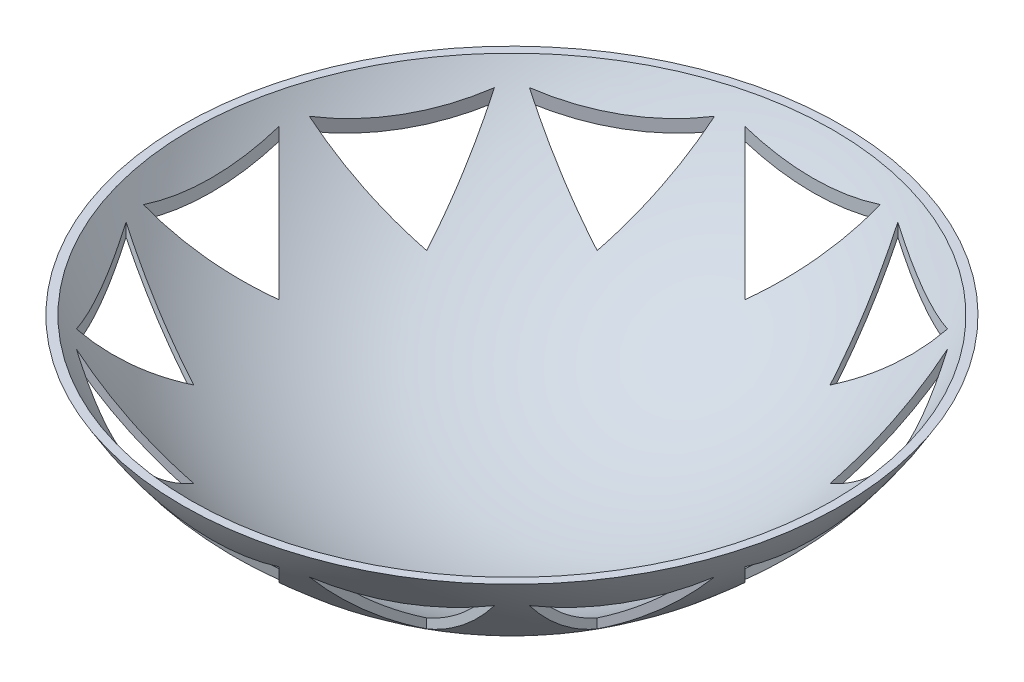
ISO-10303-21;
HEADER;
FILE_DESCRIPTION(('STEP AP214'),'2;1');
FILE_NAME('part.step','',(''),(''),'','','');
FILE_SCHEMA(('AUTOMOTIVE_DESIGN { 1 0 10303 214 1 1 1 1 }'));
ENDSEC;
DATA;
#1=APPLICATION_CONTEXT('core data for automotive mechanical design processes');
#2=APPLICATION_PROTOCOL_DEFINITION('international standard','automotive_design',2000,#1);
#3=PRODUCT_CONTEXT('',#1,'mechanical');
#4=PRODUCT('Part','Part','',(#3));
#5=PRODUCT_RELATED_PRODUCT_CATEGORY('part','',(#4));
#6=PRODUCT_DEFINITION_FORMATION('','',#4);
#7=PRODUCT_DEFINITION_CONTEXT('part definition',#1,'design');
#8=PRODUCT_DEFINITION('design','',#6,#7);
#9=PRODUCT_DEFINITION_SHAPE('','',#8);
#10=(LENGTH_UNIT() NAMED_UNIT(*) SI_UNIT(.MILLI.,.METRE.));
#11=(NAMED_UNIT(*) PLANE_ANGLE_UNIT() SI_UNIT($,.RADIAN.));
#12=(NAMED_UNIT(*) SI_UNIT($,.STERADIAN.) SOLID_ANGLE_UNIT());
#13=UNCERTAINTY_MEASURE_WITH_UNIT(LENGTH_MEASURE(1.E-05),#10,'distance_accuracy_value','');
#14=(GEOMETRIC_REPRESENTATION_CONTEXT(3) GLOBAL_UNCERTAINTY_ASSIGNED_CONTEXT((#13)) GLOBAL_UNIT_ASSIGNED_CONTEXT((#10,
#11,#12)) REPRESENTATION_CONTEXT('',''));
#15=CARTESIAN_POINT('',(0.,0.,0.));
#16=DIRECTION('',(0.,0.,1.));
#17=DIRECTION('',(1.,0.,0.));
#18=AXIS2_PLACEMENT_3D('',#15,#16,#17);
#19=CARTESIAN_POINT('',(0.,0.,0.));
#20=DIRECTION('',(0.,1.,0.));
#21=DIRECTION('',(1.,0.,0.));
#22=AXIS2_PLACEMENT_3D('',#19,#20,#21);
#23=SPHERICAL_SURFACE('',#22,50.);
#24=CARTESIAN_POINT('',(35.1198567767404,0.,-20.2764587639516));
#25=DIRECTION('',(0.866025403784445,0.,-0.499999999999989));
#26=DIRECTION('',(-0.499999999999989,0.,-0.866025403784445));
#27=AXIS2_PLACEMENT_3D('',#24,#25,#26);
#28=CIRCLE('',#27,29.2482628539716);
#29=CARTESIAN_POINT('',(30.5498233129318,-27.7834493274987,-28.1919889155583));
#30=VERTEX_POINT('',#29);
#31=CARTESIAN_POINT('',(39.689890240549,-27.7834493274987,-12.3609286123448));
#32=VERTEX_POINT('',#31);
#33=EDGE_CURVE('E579',#30,#32,#28,.F.);
#34=ORIENTED_EDGE('',*,*,#33,.T.);
#35=CARTESIAN_POINT('',(5.74895066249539,0.,-21.4553759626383));
#36=DIRECTION('',(-0.258819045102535,0.,0.965925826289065));
#37=DIRECTION('',(0.965925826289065,0.,0.258819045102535));
#38=AXIS2_PLACEMENT_3D('',#35,#36,#37);
#39=CIRCLE('',#38,44.7952721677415);
#40=CARTESIAN_POINT('',(27.2043266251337,-38.9002932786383,-15.706425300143));
#41=VERTEX_POINT('',#40);
#42=EDGE_CURVE('E271',#32,#41,#39,.F.);
#43=ORIENTED_EDGE('',*,*,#42,.T.);
#44=CARTESIAN_POINT('',(21.4553759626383,0.,5.74895066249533));
#45=DIRECTION('',(-0.965925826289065,0.,-0.258819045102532));
#46=DIRECTION('',(-0.258819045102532,0.,0.965925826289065));
#47=AXIS2_PLACEMENT_3D('',#44,#45,#46);
#48=CIRCLE('',#47,44.7952721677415);
#49=EDGE_CURVE('E576',#41,#30,#48,.F.);
#50=ORIENTED_EDGE('',*,*,#49,.T.);
#51=EDGE_LOOP('',(#34,#43,#50));
#52=FACE_BOUND('',#51,.T.);
#53=CARTESIAN_POINT('',(20.2764587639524,0.,-35.1198567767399));
#54=DIRECTION('',(0.50000000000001,0.,-0.866025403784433));
#55=DIRECTION('',(-0.866025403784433,0.,-0.50000000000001));
#56=AXIS2_PLACEMENT_3D('',#53,#54,#55);
#57=CIRCLE('',#56,29.2482628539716);
#58=CARTESIAN_POINT('',(12.3609286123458,-27.7834493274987,-39.6898902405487));
#59=VERTEX_POINT('',#58);
#60=CARTESIAN_POINT('',(28.1919889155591,-27.7834493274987,-30.5498233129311));
#61=VERTEX_POINT('',#60);
#62=EDGE_CURVE('E564',#59,#61,#57,.F.);
#63=ORIENTED_EDGE('',*,*,#62,.T.);
#64=CARTESIAN_POINT('',(-5.7489506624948,0.,-21.4553759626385));
#65=DIRECTION('',(0.258819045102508,0.,0.965925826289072));
#66=DIRECTION('',(0.965925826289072,0.,-0.258819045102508));
#67=AXIS2_PLACEMENT_3D('',#64,#65,#66);
#68=CIRCLE('',#67,44.7952721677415);
#69=CARTESIAN_POINT('',(15.7064253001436,-38.9002932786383,-27.2043266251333));
#70=VERTEX_POINT('',#69);
#71=EDGE_CURVE('E554',#61,#70,#68,.F.);
#72=ORIENTED_EDGE('',*,*,#71,.T.);
#73=CARTESIAN_POINT('',(21.4553759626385,0.,-5.74895066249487));
#74=DIRECTION('',(-0.965925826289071,0.,0.258819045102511));
#75=DIRECTION('',(0.258819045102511,0.,0.965925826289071));
#76=AXIS2_PLACEMENT_3D('',#73,#74,#75);
#77=CIRCLE('',#76,44.7952721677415);
#78=EDGE_CURVE('E561',#70,#59,#77,.F.);
#79=ORIENTED_EDGE('',*,*,#78,.T.);
#80=EDGE_LOOP('',(#63,#72,#79));
#81=FACE_BOUND('',#80,.T.);
#82=CARTESIAN_POINT('',(4.31013637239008E-13,0.,-40.552917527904));
#83=DIRECTION('',(0.,0.,-1.));
#84=DIRECTION('',(-1.,0.,0.));
#85=AXIS2_PLACEMENT_3D('',#82,#83,#84);
#86=CIRCLE('',#85,29.2482628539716);
#87=CARTESIAN_POINT('',(-9.14006692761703,-27.7834493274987,-40.5529175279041));
#88=VERTEX_POINT('',#87);
#89=CARTESIAN_POINT('',(9.14006692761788,-27.7834493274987,-40.5529175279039));
#90=VERTEX_POINT('',#89);
#91=EDGE_CURVE('E547',#88,#90,#86,.F.);
#92=ORIENTED_EDGE('',*,*,#91,.T.);
#93=CARTESIAN_POINT('',(-15.7064253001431,0.,-15.7064253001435));
#94=DIRECTION('',(0.707106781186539,0.,0.707106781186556));
#95=DIRECTION('',(0.707106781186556,0.,-0.707106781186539));
#96=AXIS2_PLACEMENT_3D('',#93,#94,#95);
#97=CIRCLE('',#96,44.7952721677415);
#98=CARTESIAN_POINT('',(3.29597460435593E-13,-38.9002932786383,-31.4128506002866));
#99=VERTEX_POINT('',#98);
#100=EDGE_CURVE('E537',#90,#99,#97,.F.);
#101=ORIENTED_EDGE('',*,*,#100,.T.);
#102=CARTESIAN_POINT('',(15.7064253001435,0.,-15.7064253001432));
#103=DIRECTION('',(-0.707106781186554,0.,0.707106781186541));
#104=DIRECTION('',(0.707106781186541,0.,0.707106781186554));
#105=AXIS2_PLACEMENT_3D('',#102,#103,#104);
#106=CIRCLE('',#105,44.7952721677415);
#107=EDGE_CURVE('E544',#99,#88,#106,.F.);
#108=ORIENTED_EDGE('',*,*,#107,.T.);
#109=EDGE_LOOP('',(#92,#101,#108));
#110=FACE_BOUND('',#109,.T.);
#111=CARTESIAN_POINT('',(-20.2764587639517,0.,-35.1198567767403));
#112=DIRECTION('',(-0.499999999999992,0.,-0.866025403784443));
#113=DIRECTION('',(-0.866025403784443,0.,0.499999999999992));
#114=AXIS2_PLACEMENT_3D('',#111,#112,#113);
#115=CIRCLE('',#114,29.2482628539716);
#116=CARTESIAN_POINT('',(-28.1919889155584,-27.7834493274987,-30.5498233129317));
#117=VERTEX_POINT('',#116);
#118=CARTESIAN_POINT('',(-12.3609286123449,-27.7834493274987,-39.689890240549));
#119=VERTEX_POINT('',#118);
#120=EDGE_CURVE('E530',#117,#119,#115,.F.);
#121=ORIENTED_EDGE('',*,*,#120,.T.);
#122=CARTESIAN_POINT('',(-21.4553759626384,0.,-5.74895066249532));
#123=DIRECTION('',(0.965925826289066,0.,0.258819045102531));
#124=DIRECTION('',(0.258819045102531,0.,-0.965925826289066));
#125=AXIS2_PLACEMENT_3D('',#122,#123,#124);
#126=CIRCLE('',#125,44.7952721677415);
#127=CARTESIAN_POINT('',(-15.706425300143,-38.9002932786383,-27.2043266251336));
#128=VERTEX_POINT('',#127);
#129=EDGE_CURVE('E520',#119,#128,#126,.F.);
#130=ORIENTED_EDGE('',*,*,#129,.T.);
#131=CARTESIAN_POINT('',(5.74895066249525,0.,-21.4553759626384));
#132=DIRECTION('',(-0.258819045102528,0.,0.965925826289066));
#133=DIRECTION('',(0.965925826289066,0.,0.258819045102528));
#134=AXIS2_PLACEMENT_3D('',#131,#132,#133);
#135=CIRCLE('',#134,44.7952721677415);
#136=EDGE_CURVE('E527',#128,#117,#135,.F.);
#137=ORIENTED_EDGE('',*,*,#136,.T.);
#138=EDGE_LOOP('',(#121,#130,#137));
#139=FACE_BOUND('',#138,.T.);
#140=CARTESIAN_POINT('',(-35.11985677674,0.,-20.2764587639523));
#141=DIRECTION('',(-0.866025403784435,0.,-0.500000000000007));
#142=DIRECTION('',(-0.500000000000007,0.,0.866025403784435));
#143=AXIS2_PLACEMENT_3D('',#140,#141,#142);
#144=CIRCLE('',#143,29.2482628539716);
#145=CARTESIAN_POINT('',(-39.6898902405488,-27.7834493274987,-12.3609286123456));
#146=VERTEX_POINT('',#145);
#147=CARTESIAN_POINT('',(-30.5498233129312,-27.7834493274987,-28.191988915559));
#148=VERTEX_POINT('',#147);
#149=EDGE_CURVE('E513',#146,#148,#144,.F.);
#150=ORIENTED_EDGE('',*,*,#149,.T.);
#151=CARTESIAN_POINT('',(-21.4553759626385,0.,5.74895066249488));
#152=DIRECTION('',(0.965925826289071,0.,-0.258819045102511));
#153=DIRECTION('',(-0.258819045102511,0.,-0.965925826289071));
#154=AXIS2_PLACEMENT_3D('',#151,#152,#153);
#155=CIRCLE('',#154,44.7952721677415);
#156=CARTESIAN_POINT('',(-27.2043266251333,-38.9002932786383,-15.7064253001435));
#157=VERTEX_POINT('',#156);
#158=EDGE_CURVE('E503',#148,#157,#155,.F.);
#159=ORIENTED_EDGE('',*,*,#158,.T.);
#160=CARTESIAN_POINT('',(-5.74895066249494,0.,-21.4553759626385));
#161=DIRECTION('',(0.258819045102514,0.,0.96592582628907));
#162=DIRECTION('',(0.96592582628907,0.,-0.258819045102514));
#163=AXIS2_PLACEMENT_3D('',#160,#161,#162);
#164=CIRCLE('',#163,44.7952721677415);
#165=EDGE_CURVE('E510',#157,#146,#164,.F.);
#166=ORIENTED_EDGE('',*,*,#165,.T.);
#167=EDGE_LOOP('',(#150,#159,#166));
#168=FACE_BOUND('',#167,.T.);
#169=CARTESIAN_POINT('',(-40.552917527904,0.,-2.77080195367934E-13));
#170=DIRECTION('',(-1.,0.,0.));
#171=DIRECTION('',(0.,0.,1.));
#172=AXIS2_PLACEMENT_3D('',#169,#170,#171);
#173=CIRCLE('',#172,29.2482628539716);
#174=CARTESIAN_POINT('',(-40.5529175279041,-27.7834493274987,9.14006692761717));
#175=VERTEX_POINT('',#174);
#176=CARTESIAN_POINT('',(-40.552917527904,-27.7834493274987,-9.14006692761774));
#177=VERTEX_POINT('',#176);
#178=EDGE_CURVE('E496',#175,#177,#173,.F.);
#179=ORIENTED_EDGE('',*,*,#178,.T.);
#180=CARTESIAN_POINT('',(-15.7064253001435,0.,15.7064253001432));
#181=DIRECTION('',(0.707106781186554,0.,-0.707106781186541));
#182=DIRECTION('',(-0.707106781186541,0.,-0.707106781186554));
#183=AXIS2_PLACEMENT_3D('',#180,#181,#182);
#184=CIRCLE('',#183,44.7952721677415);
#185=CARTESIAN_POINT('',(-31.4128506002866,-38.9002932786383,-2.18575157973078E-13));
#186=VERTEX_POINT('',#185);
#187=EDGE_CURVE('E486',#177,#186,#184,.F.);
#188=ORIENTED_EDGE('',*,*,#187,.T.);
#189=CARTESIAN_POINT('',(-15.7064253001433,0.,-15.7064253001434));
#190=DIRECTION('',(0.707106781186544,0.,0.707106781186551));
#191=DIRECTION('',(0.707106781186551,0.,-0.707106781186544));
#192=AXIS2_PLACEMENT_3D('',#189,#190,#191);
#193=CIRCLE('',#192,44.7952721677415);
#194=EDGE_CURVE('E493',#186,#175,#193,.F.);
#195=ORIENTED_EDGE('',*,*,#194,.T.);
#196=EDGE_LOOP('',(#179,#188,#195));
#197=FACE_BOUND('',#196,.T.);
#198=CARTESIAN_POINT('',(-35.1198567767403,0.,20.2764587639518));
#199=DIRECTION('',(-0.866025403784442,0.,0.499999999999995));
#200=DIRECTION('',(0.499999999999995,0.,0.866025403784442));
#201=AXIS2_PLACEMENT_3D('',#198,#199,#200);
#202=CIRCLE('',#201,29.2482628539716);
#203=CARTESIAN_POINT('',(-30.5498233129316,-27.7834493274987,28.1919889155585));
#204=VERTEX_POINT('',#203);
#205=CARTESIAN_POINT('',(-39.6898902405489,-27.7834493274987,12.3609286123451));
#206=VERTEX_POINT('',#205);
#207=EDGE_CURVE('E479',#204,#206,#202,.F.);
#208=ORIENTED_EDGE('',*,*,#207,.T.);
#209=CARTESIAN_POINT('',(-5.74895066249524,0.,21.4553759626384));
#210=DIRECTION('',(0.258819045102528,0.,-0.965925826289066));
#211=DIRECTION('',(-0.965925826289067,0.,-0.258819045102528));
#212=AXIS2_PLACEMENT_3D('',#209,#210,#211);
#213=CIRCLE('',#212,44.7952721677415);
#214=CARTESIAN_POINT('',(-27.2043266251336,-38.9002932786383,15.7064253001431));
#215=VERTEX_POINT('',#214);
#216=EDGE_CURVE('E469',#206,#215,#213,.F.);
#217=ORIENTED_EDGE('',*,*,#216,.T.);
#218=CARTESIAN_POINT('',(-21.4553759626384,0.,-5.74895066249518));
#219=DIRECTION('',(0.965925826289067,0.,0.258819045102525));
#220=DIRECTION('',(0.258819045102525,0.,-0.965925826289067));
#221=AXIS2_PLACEMENT_3D('',#218,#219,#220);
#222=CIRCLE('',#221,44.7952721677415);
#223=EDGE_CURVE('E476',#215,#204,#222,.F.);
#224=ORIENTED_EDGE('',*,*,#223,.T.);
#225=EDGE_LOOP('',(#208,#217,#224));
#226=FACE_BOUND('',#225,.T.);
#227=CARTESIAN_POINT('',(-20.2764587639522,0.,35.1198567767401));
#228=DIRECTION('',(-0.500000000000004,0.,0.866025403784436));
#229=DIRECTION('',(0.866025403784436,0.,0.500000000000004));
#230=AXIS2_PLACEMENT_3D('',#227,#228,#229);
#231=CIRCLE('',#230,29.2482628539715);
#232=CARTESIAN_POINT('',(-12.3609286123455,-27.7834493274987,39.6898902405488));
#233=VERTEX_POINT('',#232);
#234=CARTESIAN_POINT('',(-28.1919889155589,-27.7834493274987,30.5498233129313));
#235=VERTEX_POINT('',#234);
#236=EDGE_CURVE('E462',#233,#235,#231,.F.);
#237=ORIENTED_EDGE('',*,*,#236,.T.);
#238=CARTESIAN_POINT('',(5.74895066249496,0.,21.4553759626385));
#239=DIRECTION('',(-0.258819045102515,0.,-0.96592582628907));
#240=DIRECTION('',(-0.96592582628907,0.,0.258819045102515));
#241=AXIS2_PLACEMENT_3D('',#238,#239,#240);
#242=CIRCLE('',#241,44.7952721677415);
#243=CARTESIAN_POINT('',(-15.7064253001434,-38.9002932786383,27.2043266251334));
#244=VERTEX_POINT('',#243);
#245=EDGE_CURVE('E452',#235,#244,#242,.F.);
#246=ORIENTED_EDGE('',*,*,#245,.T.);
#247=CARTESIAN_POINT('',(-21.4553759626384,0.,5.74895066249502));
#248=DIRECTION('',(0.965925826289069,0.,-0.258819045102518));
#249=DIRECTION('',(-0.258819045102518,0.,-0.965925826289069));
#250=AXIS2_PLACEMENT_3D('',#247,#248,#249);
#251=CIRCLE('',#250,44.7952721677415);
#252=EDGE_CURVE('E459',#244,#233,#251,.F.);
#253=ORIENTED_EDGE('',*,*,#252,.T.);
#254=EDGE_LOOP('',(#237,#246,#253));
#255=FACE_BOUND('',#254,.T.);
#256=CARTESIAN_POINT('',(-1.53933441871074E-13,0.,40.552917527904));
#257=DIRECTION('',(0.,0.,1.));
#258=DIRECTION('',(1.,0.,0.));
#259=AXIS2_PLACEMENT_3D('',#256,#257,#258);
#260=CIRCLE('',#259,29.2482628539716);
#261=CARTESIAN_POINT('',(9.14006692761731,-27.7834493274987,40.5529175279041));
#262=VERTEX_POINT('',#261);
#263=CARTESIAN_POINT('',(-9.1400669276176,-27.7834493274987,40.552917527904));
#264=VERTEX_POINT('',#263);
#265=EDGE_CURVE('E445',#262,#264,#260,.F.);
#266=ORIENTED_EDGE('',*,*,#265,.T.);
#267=CARTESIAN_POINT('',(15.7064253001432,0.,15.7064253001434));
#268=DIRECTION('',(-0.707106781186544,0.,-0.707106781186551));
#269=DIRECTION('',(-0.707106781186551,0.,0.707106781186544));
#270=AXIS2_PLACEMENT_3D('',#267,#268,#269);
#271=CIRCLE('',#270,44.7952721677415);
#272=CARTESIAN_POINT('',(-1.07552855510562E-13,-38.9002932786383,31.4128506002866));
#273=VERTEX_POINT('',#272);
#274=EDGE_CURVE('E435',#264,#273,#271,.F.);
#275=ORIENTED_EDGE('',*,*,#274,.T.);
#276=CARTESIAN_POINT('',(-15.7064253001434,0.,15.7064253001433));
#277=DIRECTION('',(0.707106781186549,0.,-0.707106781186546));
#278=DIRECTION('',(-0.707106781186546,0.,-0.707106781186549));
#279=AXIS2_PLACEMENT_3D('',#276,#277,#278);
#280=CIRCLE('',#279,44.7952721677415);
#281=EDGE_CURVE('E442',#273,#262,#280,.F.);
#282=ORIENTED_EDGE('',*,*,#281,.T.);
#283=EDGE_LOOP('',(#266,#275,#282));
#284=FACE_BOUND('',#283,.T.);
#285=CARTESIAN_POINT('',(20.2764587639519,0.,35.1198567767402));
#286=DIRECTION('',(0.499999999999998,0.,0.86602540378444));
#287=DIRECTION('',(0.86602540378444,0.,-0.499999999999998));
#288=AXIS2_PLACEMENT_3D('',#285,#286,#287);
#289=CIRCLE('',#288,29.2482628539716);
#290=CARTESIAN_POINT('',(28.1919889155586,-27.7834493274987,30.5498233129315));
#291=VERTEX_POINT('',#290);
#292=CARTESIAN_POINT('',(12.3609286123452,-27.7834493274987,39.6898902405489));
#293=VERTEX_POINT('',#292);
#294=EDGE_CURVE('E428',#291,#293,#289,.F.);
#295=ORIENTED_EDGE('',*,*,#294,.T.);
#296=CARTESIAN_POINT('',(21.4553759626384,0.,5.74895066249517));
#297=DIRECTION('',(-0.965925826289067,0.,-0.258819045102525));
#298=DIRECTION('',(-0.258819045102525,0.,0.965925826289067));
#299=AXIS2_PLACEMENT_3D('',#296,#297,#298);
#300=CIRCLE('',#299,44.7952721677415);
#301=CARTESIAN_POINT('',(15.7064253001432,-38.9002932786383,27.2043266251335));
#302=VERTEX_POINT('',#301);
#303=EDGE_CURVE('E418',#293,#302,#300,.F.);
#304=ORIENTED_EDGE('',*,*,#303,.T.);
#305=CARTESIAN_POINT('',(-5.7489506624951,0.,21.4553759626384));
#306=DIRECTION('',(0.258819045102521,0.,-0.965925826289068));
#307=DIRECTION('',(-0.965925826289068,0.,-0.258819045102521));
#308=AXIS2_PLACEMENT_3D('',#305,#306,#307);
#309=CIRCLE('',#308,44.7952721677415);
#310=EDGE_CURVE('E425',#302,#291,#309,.F.);
#311=ORIENTED_EDGE('',*,*,#310,.T.);
#312=EDGE_LOOP('',(#295,#304,#311));
#313=FACE_BOUND('',#312,.T.);
#314=CARTESIAN_POINT('',(35.1198567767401,0.,20.2764587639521));
#315=DIRECTION('',(0.866025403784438,0.,0.500000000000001));
#316=DIRECTION('',(0.500000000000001,0.,-0.866025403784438));
#317=AXIS2_PLACEMENT_3D('',#314,#315,#316);
#318=CIRCLE('',#317,29.2482628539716);
#319=CARTESIAN_POINT('',(39.6898902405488,-27.7834493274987,12.3609286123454));
#320=VERTEX_POINT('',#319);
#321=CARTESIAN_POINT('',(30.5498233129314,-27.7834493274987,28.1919889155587));
#322=VERTEX_POINT('',#321);
#323=EDGE_CURVE('E411',#320,#322,#318,.F.);
#324=ORIENTED_EDGE('',*,*,#323,.T.);
#325=CARTESIAN_POINT('',(21.4553759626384,0.,-5.74895066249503));
#326=DIRECTION('',(-0.965925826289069,0.,0.258819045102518));
#327=DIRECTION('',(0.258819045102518,0.,0.965925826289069));
#328=AXIS2_PLACEMENT_3D('',#325,#326,#327);
#329=CIRCLE('',#328,44.7952721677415);
#330=CARTESIAN_POINT('',(27.2043266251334,-38.9002932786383,15.7064253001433));
#331=VERTEX_POINT('',#330);
#332=EDGE_CURVE('E401',#322,#331,#329,.F.);
#333=ORIENTED_EDGE('',*,*,#332,.T.);
#334=CARTESIAN_POINT('',(5.74895066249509,0.,21.4553759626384));
#335=DIRECTION('',(-0.258819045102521,0.,-0.965925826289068));
#336=DIRECTION('',(-0.965925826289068,0.,0.258819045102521));
#337=AXIS2_PLACEMENT_3D('',#334,#335,#336);
#338=CIRCLE('',#337,44.7952721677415);
#339=EDGE_CURVE('E408',#331,#320,#338,.F.);
#340=ORIENTED_EDGE('',*,*,#339,.T.);
#341=EDGE_LOOP('',(#324,#333,#340));
#342=FACE_BOUND('',#341,.T.);
#343=CARTESIAN_POINT('',(40.552917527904,0.,0.));
#344=DIRECTION('',(1.,0.,0.));
#345=DIRECTION('',(0.,0.,-1.));
#346=AXIS2_PLACEMENT_3D('',#343,#344,#345);
#347=CIRCLE('',#346,29.2482628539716);
#348=CARTESIAN_POINT('',(40.552917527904,-27.7834493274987,-9.14006692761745));
#349=VERTEX_POINT('',#348);
#350=CARTESIAN_POINT('',(40.552917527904,-27.7834493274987,9.14006692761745));
#351=VERTEX_POINT('',#350);
#352=EDGE_CURVE('E394',#349,#351,#347,.F.);
#353=ORIENTED_EDGE('',*,*,#352,.T.);
#354=CARTESIAN_POINT('',(15.7064253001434,0.,-15.7064253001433));
#355=DIRECTION('',(-0.707106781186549,0.,0.707106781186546));
#356=DIRECTION('',(0.707106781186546,0.,0.707106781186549));
#357=AXIS2_PLACEMENT_3D('',#354,#355,#356);
#358=CIRCLE('',#357,44.7952721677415);
#359=CARTESIAN_POINT('',(31.4128506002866,-38.9002932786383,0.));
#360=VERTEX_POINT('',#359);
#361=EDGE_CURVE('E388',#351,#360,#358,.F.);
#362=ORIENTED_EDGE('',*,*,#361,.T.);
#363=CARTESIAN_POINT('',(15.7064253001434,0.,15.7064253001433));
#364=DIRECTION('',(-0.707106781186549,0.,-0.707106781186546));
#365=DIRECTION('',(-0.707106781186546,0.,0.707106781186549));
#366=AXIS2_PLACEMENT_3D('',#363,#364,#365);
#367=CIRCLE('',#366,44.7952721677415);
#368=EDGE_CURVE('E391',#360,#349,#367,.F.);
#369=ORIENTED_EDGE('',*,*,#368,.T.);
#370=EDGE_LOOP('',(#353,#362,#369));
#371=FACE_BOUND('',#370,.T.);
#372=CARTESIAN_POINT('',(0.,-49.9999999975,0.));
#373=DIRECTION('',(0.,1.,0.));
#374=DIRECTION('',(0.,0.,1.));
#375=AXIS2_PLACEMENT_3D('',#372,#373,#374);
#376=CIRCLE('',#375,0.000500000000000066);
#377=CARTESIAN_POINT('',(0.,-49.9999999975,0.000500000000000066));
#378=VERTEX_POINT('',#377);
#379=EDGE_CURVE('E382',#378,#378,#376,.F.);
#380=ORIENTED_EDGE('',*,*,#379,.T.);
#381=EDGE_LOOP('',(#380));
#382=FACE_BOUND('',#381,.T.);
#383=CARTESIAN_POINT('',(0.,-25.,0.));
#384=DIRECTION('',(0.,1.,0.));
#385=DIRECTION('',(0.,0.,1.));
#386=AXIS2_PLACEMENT_3D('',#383,#384,#385);
#387=CIRCLE('',#386,43.3012701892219);
#388=CARTESIAN_POINT('',(0.,-25.,43.3012701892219));
#389=VERTEX_POINT('',#388);
#390=EDGE_CURVE('E379',#389,#389,#387,.T.);
#391=ORIENTED_EDGE('',*,*,#390,.T.);
#392=EDGE_LOOP('',(#391));
#393=FACE_BOUND('',#392,.T.);
#394=ADVANCED_FACE('F31',(#52,#81,#110,#139,#168,#197,#226,#255,#284,#313,#342,#371,#382,#393),
#23,.F.);
#395=CARTESIAN_POINT('',(0.,0.,0.));
#396=DIRECTION('',(0.,1.,0.));
#397=DIRECTION('',(1.,0.,0.));
#398=AXIS2_PLACEMENT_3D('',#395,#396,#397);
#399=SPHERICAL_SURFACE('',#398,51.);
#400=CARTESIAN_POINT('',(21.4553759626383,0.,5.74895066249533));
#401=DIRECTION('',(-0.965925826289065,0.,-0.258819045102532));
#402=DIRECTION('',(-0.258819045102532,0.,0.965925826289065));
#403=AXIS2_PLACEMENT_3D('',#400,#401,#402);
#404=CIRCLE('',#403,45.9087835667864);
#405=CARTESIAN_POINT('',(30.5498233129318,-29.5452205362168,-28.1919889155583));
#406=VERTEX_POINT('',#405);
#407=CARTESIAN_POINT('',(27.2043266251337,-40.1775163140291,-15.706425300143));
#408=VERTEX_POINT('',#407);
#409=EDGE_CURVE('E38',#406,#408,#404,.T.);
#410=ORIENTED_EDGE('',*,*,#409,.T.);
#411=CARTESIAN_POINT('',(5.74895066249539,0.,-21.4553759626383));
#412=DIRECTION('',(-0.258819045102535,0.,0.965925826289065));
#413=DIRECTION('',(0.965925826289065,0.,0.258819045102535));
#414=AXIS2_PLACEMENT_3D('',#411,#412,#413);
#415=CIRCLE('',#414,45.9087835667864);
#416=CARTESIAN_POINT('',(39.689890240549,-29.5452205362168,-12.3609286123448));
#417=VERTEX_POINT('',#416);
#418=EDGE_CURVE('E11',#408,#417,#415,.T.);
#419=ORIENTED_EDGE('',*,*,#418,.T.);
#420=CARTESIAN_POINT('',(35.1198567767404,0.,-20.2764587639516));
#421=DIRECTION('',(0.866025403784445,0.,-0.499999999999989));
#422=DIRECTION('',(-0.499999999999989,0.,-0.866025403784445));
#423=AXIS2_PLACEMENT_3D('',#420,#421,#422);
#424=CIRCLE('',#423,30.9267017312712);
#425=EDGE_CURVE('E260',#417,#406,#424,.T.);
#426=ORIENTED_EDGE('',*,*,#425,.T.);
#427=EDGE_LOOP('',(#410,#419,#426));
#428=FACE_BOUND('',#427,.T.);
#429=CARTESIAN_POINT('',(21.4553759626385,0.,-5.74895066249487));
#430=DIRECTION('',(-0.965925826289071,0.,0.258819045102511));
#431=DIRECTION('',(0.258819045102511,0.,0.965925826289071));
#432=AXIS2_PLACEMENT_3D('',#429,#430,#431);
#433=CIRCLE('',#432,45.9087835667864);
#434=CARTESIAN_POINT('',(12.3609286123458,-29.5452205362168,-39.6898902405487));
#435=VERTEX_POINT('',#434);
#436=CARTESIAN_POINT('',(15.7064253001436,-40.1775163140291,-27.2043266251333));
#437=VERTEX_POINT('',#436);
#438=EDGE_CURVE('E280',#435,#437,#433,.T.);
#439=ORIENTED_EDGE('',*,*,#438,.T.);
#440=CARTESIAN_POINT('',(-5.7489506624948,0.,-21.4553759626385));
#441=DIRECTION('',(0.258819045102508,0.,0.965925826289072));
#442=DIRECTION('',(0.965925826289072,0.,-0.258819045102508));
#443=AXIS2_PLACEMENT_3D('',#440,#441,#442);
#444=CIRCLE('',#443,45.9087835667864);
#445=CARTESIAN_POINT('',(28.1919889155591,-29.5452205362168,-30.5498233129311));
#446=VERTEX_POINT('',#445);
#447=EDGE_CURVE('E264',#437,#446,#444,.T.);
#448=ORIENTED_EDGE('',*,*,#447,.T.);
#449=CARTESIAN_POINT('',(20.2764587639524,0.,-35.1198567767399));
#450=DIRECTION('',(0.50000000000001,0.,-0.866025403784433));
#451=DIRECTION('',(-0.866025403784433,0.,-0.50000000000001));
#452=AXIS2_PLACEMENT_3D('',#449,#450,#451);
#453=CIRCLE('',#452,30.9267017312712);
#454=EDGE_CURVE('E283',#446,#435,#453,.T.);
#455=ORIENTED_EDGE('',*,*,#454,.T.);
#456=EDGE_LOOP('',(#439,#448,#455));
#457=FACE_BOUND('',#456,.T.);
#458=CARTESIAN_POINT('',(15.7064253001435,0.,-15.7064253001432));
#459=DIRECTION('',(-0.707106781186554,0.,0.707106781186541));
#460=DIRECTION('',(0.707106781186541,0.,0.707106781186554));
#461=AXIS2_PLACEMENT_3D('',#458,#459,#460);
#462=CIRCLE('',#461,45.9087835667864);
#463=CARTESIAN_POINT('',(-9.14006692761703,-29.5452205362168,-40.5529175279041));
#464=VERTEX_POINT('',#463);
#465=CARTESIAN_POINT('',(3.29597460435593E-13,-40.1775163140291,-31.4128506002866));
#466=VERTEX_POINT('',#465);
#467=EDGE_CURVE('E289',#464,#466,#462,.T.);
#468=ORIENTED_EDGE('',*,*,#467,.T.);
#469=CARTESIAN_POINT('',(-15.7064253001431,0.,-15.7064253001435));
#470=DIRECTION('',(0.707106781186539,0.,0.707106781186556));
#471=DIRECTION('',(0.707106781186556,0.,-0.707106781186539));
#472=AXIS2_PLACEMENT_3D('',#469,#470,#471);
#473=CIRCLE('',#472,45.9087835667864);
#474=CARTESIAN_POINT('',(9.14006692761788,-29.5452205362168,-40.5529175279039));
#475=VERTEX_POINT('',#474);
#476=EDGE_CURVE('E286',#466,#475,#473,.T.);
#477=ORIENTED_EDGE('',*,*,#476,.T.);
#478=CARTESIAN_POINT('',(4.31013637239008E-13,0.,-40.552917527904));
#479=DIRECTION('',(0.,0.,-1.));
#480=DIRECTION('',(-1.,0.,0.));
#481=AXIS2_PLACEMENT_3D('',#478,#479,#480);
#482=CIRCLE('',#481,30.9267017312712);
#483=EDGE_CURVE('E292',#475,#464,#482,.T.);
#484=ORIENTED_EDGE('',*,*,#483,.T.);
#485=EDGE_LOOP('',(#468,#477,#484));
#486=FACE_BOUND('',#485,.T.);
#487=CARTESIAN_POINT('',(5.74895066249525,0.,-21.4553759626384));
#488=DIRECTION('',(-0.258819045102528,0.,0.965925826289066));
#489=DIRECTION('',(0.965925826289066,0.,0.258819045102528));
#490=AXIS2_PLACEMENT_3D('',#487,#488,#489);
#491=CIRCLE('',#490,45.9087835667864);
#492=CARTESIAN_POINT('',(-28.1919889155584,-29.5452205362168,-30.5498233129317));
#493=VERTEX_POINT('',#492);
#494=CARTESIAN_POINT('',(-15.706425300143,-40.1775163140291,-27.2043266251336));
#495=VERTEX_POINT('',#494);
#496=EDGE_CURVE('E298',#493,#495,#491,.T.);
#497=ORIENTED_EDGE('',*,*,#496,.T.);
#498=CARTESIAN_POINT('',(-21.4553759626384,0.,-5.74895066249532));
#499=DIRECTION('',(0.965925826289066,0.,0.258819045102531));
#500=DIRECTION('',(0.258819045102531,0.,-0.965925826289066));
#501=AXIS2_PLACEMENT_3D('',#498,#499,#500);
#502=CIRCLE('',#501,45.9087835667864);
#503=CARTESIAN_POINT('',(-12.3609286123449,-29.5452205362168,-39.689890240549));
#504=VERTEX_POINT('',#503);
#505=EDGE_CURVE('E295',#495,#504,#502,.T.);
#506=ORIENTED_EDGE('',*,*,#505,.T.);
#507=CARTESIAN_POINT('',(-20.2764587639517,0.,-35.1198567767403));
#508=DIRECTION('',(-0.499999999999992,0.,-0.866025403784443));
#509=DIRECTION('',(-0.866025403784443,0.,0.499999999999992));
#510=AXIS2_PLACEMENT_3D('',#507,#508,#509);
#511=CIRCLE('',#510,30.9267017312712);
#512=EDGE_CURVE('E301',#504,#493,#511,.T.);
#513=ORIENTED_EDGE('',*,*,#512,.T.);
#514=EDGE_LOOP('',(#497,#506,#513));
#515=FACE_BOUND('',#514,.T.);
#516=CARTESIAN_POINT('',(-5.74895066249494,0.,-21.4553759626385));
#517=DIRECTION('',(0.258819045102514,0.,0.96592582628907));
#518=DIRECTION('',(0.96592582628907,0.,-0.258819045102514));
#519=AXIS2_PLACEMENT_3D('',#516,#517,#518);
#520=CIRCLE('',#519,45.9087835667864);
#521=CARTESIAN_POINT('',(-39.6898902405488,-29.5452205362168,-12.3609286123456));
#522=VERTEX_POINT('',#521);
#523=CARTESIAN_POINT('',(-27.2043266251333,-40.1775163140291,-15.7064253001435));
#524=VERTEX_POINT('',#523);
#525=EDGE_CURVE('E307',#522,#524,#520,.T.);
#526=ORIENTED_EDGE('',*,*,#525,.T.);
#527=CARTESIAN_POINT('',(-21.4553759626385,0.,5.74895066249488));
#528=DIRECTION('',(0.965925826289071,0.,-0.258819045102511));
#529=DIRECTION('',(-0.258819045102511,0.,-0.965925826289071));
#530=AXIS2_PLACEMENT_3D('',#527,#528,#529);
#531=CIRCLE('',#530,45.9087835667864);
#532=CARTESIAN_POINT('',(-30.5498233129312,-29.5452205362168,-28.191988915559));
#533=VERTEX_POINT('',#532);
#534=EDGE_CURVE('E304',#524,#533,#531,.T.);
#535=ORIENTED_EDGE('',*,*,#534,.T.);
#536=CARTESIAN_POINT('',(-35.11985677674,0.,-20.2764587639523));
#537=DIRECTION('',(-0.866025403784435,0.,-0.500000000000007));
#538=DIRECTION('',(-0.500000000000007,0.,0.866025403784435));
#539=AXIS2_PLACEMENT_3D('',#536,#537,#538);
#540=CIRCLE('',#539,30.9267017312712);
#541=EDGE_CURVE('E310',#533,#522,#540,.T.);
#542=ORIENTED_EDGE('',*,*,#541,.T.);
#543=EDGE_LOOP('',(#526,#535,#542));
#544=FACE_BOUND('',#543,.T.);
#545=CARTESIAN_POINT('',(-15.7064253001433,0.,-15.7064253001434));
#546=DIRECTION('',(0.707106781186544,0.,0.707106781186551));
#547=DIRECTION('',(0.707106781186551,0.,-0.707106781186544));
#548=AXIS2_PLACEMENT_3D('',#545,#546,#547);
#549=CIRCLE('',#548,45.9087835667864);
#550=CARTESIAN_POINT('',(-40.5529175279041,-29.5452205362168,9.14006692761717));
#551=VERTEX_POINT('',#550);
#552=CARTESIAN_POINT('',(-31.4128506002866,-40.1775163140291,-2.18575157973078E-13));
#553=VERTEX_POINT('',#552);
#554=EDGE_CURVE('E316',#551,#553,#549,.T.);
#555=ORIENTED_EDGE('',*,*,#554,.T.);
#556=CARTESIAN_POINT('',(-15.7064253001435,0.,15.7064253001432));
#557=DIRECTION('',(0.707106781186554,0.,-0.707106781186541));
#558=DIRECTION('',(-0.707106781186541,0.,-0.707106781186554));
#559=AXIS2_PLACEMENT_3D('',#556,#557,#558);
#560=CIRCLE('',#559,45.9087835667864);
#561=CARTESIAN_POINT('',(-40.552917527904,-29.5452205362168,-9.14006692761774));
#562=VERTEX_POINT('',#561);
#563=EDGE_CURVE('E313',#553,#562,#560,.T.);
#564=ORIENTED_EDGE('',*,*,#563,.T.);
#565=CARTESIAN_POINT('',(-40.552917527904,0.,-2.77080195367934E-13));
#566=DIRECTION('',(-1.,0.,0.));
#567=DIRECTION('',(0.,0.,1.));
#568=AXIS2_PLACEMENT_3D('',#565,#566,#567);
#569=CIRCLE('',#568,30.9267017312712);
#570=EDGE_CURVE('E319',#562,#551,#569,.T.);
#571=ORIENTED_EDGE('',*,*,#570,.T.);
#572=EDGE_LOOP('',(#555,#564,#571));
#573=FACE_BOUND('',#572,.T.);
#574=CARTESIAN_POINT('',(-21.4553759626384,0.,-5.74895066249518));
#575=DIRECTION('',(0.965925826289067,0.,0.258819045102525));
#576=DIRECTION('',(0.258819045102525,0.,-0.965925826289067));
#577=AXIS2_PLACEMENT_3D('',#574,#575,#576);
#578=CIRCLE('',#577,45.9087835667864);
#579=CARTESIAN_POINT('',(-30.5498233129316,-29.5452205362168,28.1919889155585));
#580=VERTEX_POINT('',#579);
#581=CARTESIAN_POINT('',(-27.2043266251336,-40.1775163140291,15.7064253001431));
#582=VERTEX_POINT('',#581);
#583=EDGE_CURVE('E325',#580,#582,#578,.T.);
#584=ORIENTED_EDGE('',*,*,#583,.T.);
#585=CARTESIAN_POINT('',(-5.74895066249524,0.,21.4553759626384));
#586=DIRECTION('',(0.258819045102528,0.,-0.965925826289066));
#587=DIRECTION('',(-0.965925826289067,0.,-0.258819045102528));
#588=AXIS2_PLACEMENT_3D('',#585,#586,#587);
#589=CIRCLE('',#588,45.9087835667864);
#590=CARTESIAN_POINT('',(-39.6898902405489,-29.5452205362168,12.3609286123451));
#591=VERTEX_POINT('',#590);
#592=EDGE_CURVE('E322',#582,#591,#589,.T.);
#593=ORIENTED_EDGE('',*,*,#592,.T.);
#594=CARTESIAN_POINT('',(-35.1198567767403,0.,20.2764587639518));
#595=DIRECTION('',(-0.866025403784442,0.,0.499999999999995));
#596=DIRECTION('',(0.499999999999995,0.,0.866025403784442));
#597=AXIS2_PLACEMENT_3D('',#594,#595,#596);
#598=CIRCLE('',#597,30.9267017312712);
#599=EDGE_CURVE('E328',#591,#580,#598,.T.);
#600=ORIENTED_EDGE('',*,*,#599,.T.);
#601=EDGE_LOOP('',(#584,#593,#600));
#602=FACE_BOUND('',#601,.T.);
#603=CARTESIAN_POINT('',(-21.4553759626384,0.,5.74895066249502));
#604=DIRECTION('',(0.965925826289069,0.,-0.258819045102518));
#605=DIRECTION('',(-0.258819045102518,0.,-0.965925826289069));
#606=AXIS2_PLACEMENT_3D('',#603,#604,#605);
#607=CIRCLE('',#606,45.9087835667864);
#608=CARTESIAN_POINT('',(-12.3609286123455,-29.5452205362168,39.6898902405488));
#609=VERTEX_POINT('',#608);
#610=CARTESIAN_POINT('',(-15.7064253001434,-40.1775163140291,27.2043266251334));
#611=VERTEX_POINT('',#610);
#612=EDGE_CURVE('E334',#609,#611,#607,.T.);
#613=ORIENTED_EDGE('',*,*,#612,.T.);
#614=CARTESIAN_POINT('',(5.74895066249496,0.,21.4553759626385));
#615=DIRECTION('',(-0.258819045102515,0.,-0.96592582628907));
#616=DIRECTION('',(-0.96592582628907,0.,0.258819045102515));
#617=AXIS2_PLACEMENT_3D('',#614,#615,#616);
#618=CIRCLE('',#617,45.9087835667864);
#619=CARTESIAN_POINT('',(-28.1919889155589,-29.5452205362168,30.5498233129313));
#620=VERTEX_POINT('',#619);
#621=EDGE_CURVE('E331',#611,#620,#618,.T.);
#622=ORIENTED_EDGE('',*,*,#621,.T.);
#623=CARTESIAN_POINT('',(-20.2764587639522,0.,35.1198567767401));
#624=DIRECTION('',(-0.500000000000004,0.,0.866025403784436));
#625=DIRECTION('',(0.866025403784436,0.,0.500000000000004));
#626=AXIS2_PLACEMENT_3D('',#623,#624,#625);
#627=CIRCLE('',#626,30.9267017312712);
#628=EDGE_CURVE('E337',#620,#609,#627,.T.);
#629=ORIENTED_EDGE('',*,*,#628,.T.);
#630=EDGE_LOOP('',(#613,#622,#629));
#631=FACE_BOUND('',#630,.T.);
#632=CARTESIAN_POINT('',(-15.7064253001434,0.,15.7064253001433));
#633=DIRECTION('',(0.707106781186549,0.,-0.707106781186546));
#634=DIRECTION('',(-0.707106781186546,0.,-0.707106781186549));
#635=AXIS2_PLACEMENT_3D('',#632,#633,#634);
#636=CIRCLE('',#635,45.9087835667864);
#637=CARTESIAN_POINT('',(9.14006692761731,-29.5452205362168,40.5529175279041));
#638=VERTEX_POINT('',#637);
#639=CARTESIAN_POINT('',(-1.07552855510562E-13,-40.1775163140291,31.4128506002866));
#640=VERTEX_POINT('',#639);
#641=EDGE_CURVE('E343',#638,#640,#636,.T.);
#642=ORIENTED_EDGE('',*,*,#641,.T.);
#643=CARTESIAN_POINT('',(15.7064253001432,0.,15.7064253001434));
#644=DIRECTION('',(-0.707106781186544,0.,-0.707106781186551));
#645=DIRECTION('',(-0.707106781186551,0.,0.707106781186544));
#646=AXIS2_PLACEMENT_3D('',#643,#644,#645);
#647=CIRCLE('',#646,45.9087835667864);
#648=CARTESIAN_POINT('',(-9.1400669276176,-29.5452205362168,40.552917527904));
#649=VERTEX_POINT('',#648);
#650=EDGE_CURVE('E340',#640,#649,#647,.T.);
#651=ORIENTED_EDGE('',*,*,#650,.T.);
#652=CARTESIAN_POINT('',(-1.53933441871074E-13,0.,40.552917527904));
#653=DIRECTION('',(0.,0.,1.));
#654=DIRECTION('',(1.,0.,0.));
#655=AXIS2_PLACEMENT_3D('',#652,#653,#654);
#656=CIRCLE('',#655,30.9267017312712);
#657=EDGE_CURVE('E346',#649,#638,#656,.T.);
#658=ORIENTED_EDGE('',*,*,#657,.T.);
#659=EDGE_LOOP('',(#642,#651,#658));
#660=FACE_BOUND('',#659,.T.);
#661=CARTESIAN_POINT('',(-5.7489506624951,0.,21.4553759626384));
#662=DIRECTION('',(0.258819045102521,0.,-0.965925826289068));
#663=DIRECTION('',(-0.965925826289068,0.,-0.258819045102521));
#664=AXIS2_PLACEMENT_3D('',#661,#662,#663);
#665=CIRCLE('',#664,45.9087835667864);
#666=CARTESIAN_POINT('',(28.1919889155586,-29.5452205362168,30.5498233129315));
#667=VERTEX_POINT('',#666);
#668=CARTESIAN_POINT('',(15.7064253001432,-40.1775163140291,27.2043266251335));
#669=VERTEX_POINT('',#668);
#670=EDGE_CURVE('E352',#667,#669,#665,.T.);
#671=ORIENTED_EDGE('',*,*,#670,.T.);
#672=CARTESIAN_POINT('',(21.4553759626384,0.,5.74895066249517));
#673=DIRECTION('',(-0.965925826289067,0.,-0.258819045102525));
#674=DIRECTION('',(-0.258819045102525,0.,0.965925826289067));
#675=AXIS2_PLACEMENT_3D('',#672,#673,#674);
#676=CIRCLE('',#675,45.9087835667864);
#677=CARTESIAN_POINT('',(12.3609286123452,-29.5452205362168,39.6898902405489));
#678=VERTEX_POINT('',#677);
#679=EDGE_CURVE('E349',#669,#678,#676,.T.);
#680=ORIENTED_EDGE('',*,*,#679,.T.);
#681=CARTESIAN_POINT('',(20.2764587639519,0.,35.1198567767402));
#682=DIRECTION('',(0.499999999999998,0.,0.86602540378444));
#683=DIRECTION('',(0.86602540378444,0.,-0.499999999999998));
#684=AXIS2_PLACEMENT_3D('',#681,#682,#683);
#685=CIRCLE('',#684,30.9267017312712);
#686=EDGE_CURVE('E355',#678,#667,#685,.T.);
#687=ORIENTED_EDGE('',*,*,#686,.T.);
#688=EDGE_LOOP('',(#671,#680,#687));
#689=FACE_BOUND('',#688,.T.);
#690=CARTESIAN_POINT('',(5.74895066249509,0.,21.4553759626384));
#691=DIRECTION('',(-0.258819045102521,0.,-0.965925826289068));
#692=DIRECTION('',(-0.965925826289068,0.,0.258819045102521));
#693=AXIS2_PLACEMENT_3D('',#690,#691,#692);
#694=CIRCLE('',#693,45.9087835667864);
#695=CARTESIAN_POINT('',(39.6898902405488,-29.5452205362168,12.3609286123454));
#696=VERTEX_POINT('',#695);
#697=CARTESIAN_POINT('',(27.2043266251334,-40.1775163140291,15.7064253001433));
#698=VERTEX_POINT('',#697);
#699=EDGE_CURVE('E361',#696,#698,#694,.T.);
#700=ORIENTED_EDGE('',*,*,#699,.T.);
#701=CARTESIAN_POINT('',(21.4553759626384,0.,-5.74895066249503));
#702=DIRECTION('',(-0.965925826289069,0.,0.258819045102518));
#703=DIRECTION('',(0.258819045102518,0.,0.965925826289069));
#704=AXIS2_PLACEMENT_3D('',#701,#702,#703);
#705=CIRCLE('',#704,45.9087835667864);
#706=CARTESIAN_POINT('',(30.5498233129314,-29.5452205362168,28.1919889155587));
#707=VERTEX_POINT('',#706);
#708=EDGE_CURVE('E358',#698,#707,#705,.T.);
#709=ORIENTED_EDGE('',*,*,#708,.T.);
#710=CARTESIAN_POINT('',(35.1198567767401,0.,20.2764587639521));
#711=DIRECTION('',(0.866025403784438,0.,0.500000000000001));
#712=DIRECTION('',(0.500000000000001,0.,-0.866025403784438));
#713=AXIS2_PLACEMENT_3D('',#710,#711,#712);
#714=CIRCLE('',#713,30.9267017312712);
#715=EDGE_CURVE('E364',#707,#696,#714,.T.);
#716=ORIENTED_EDGE('',*,*,#715,.T.);
#717=EDGE_LOOP('',(#700,#709,#716));
#718=FACE_BOUND('',#717,.T.);
#719=CARTESIAN_POINT('',(15.7064253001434,0.,15.7064253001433));
#720=DIRECTION('',(-0.707106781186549,0.,-0.707106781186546));
#721=DIRECTION('',(-0.707106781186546,0.,0.707106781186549));
#722=AXIS2_PLACEMENT_3D('',#719,#720,#721);
#723=CIRCLE('',#722,45.9087835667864);
#724=CARTESIAN_POINT('',(40.552917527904,-29.5452205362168,-9.14006692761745));
#725=VERTEX_POINT('',#724);
#726=CARTESIAN_POINT('',(31.4128506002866,-40.1775163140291,0.));
#727=VERTEX_POINT('',#726);
#728=EDGE_CURVE('E370',#725,#727,#723,.T.);
#729=ORIENTED_EDGE('',*,*,#728,.T.);
#730=CARTESIAN_POINT('',(15.7064253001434,0.,-15.7064253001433));
#731=DIRECTION('',(-0.707106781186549,0.,0.707106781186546));
#732=DIRECTION('',(0.707106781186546,0.,0.707106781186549));
#733=AXIS2_PLACEMENT_3D('',#730,#731,#732);
#734=CIRCLE('',#733,45.9087835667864);
#735=CARTESIAN_POINT('',(40.552917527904,-29.5452205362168,9.14006692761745));
#736=VERTEX_POINT('',#735);
#737=EDGE_CURVE('E367',#727,#736,#734,.T.);
#738=ORIENTED_EDGE('',*,*,#737,.T.);
#739=CARTESIAN_POINT('',(40.552917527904,0.,0.));
#740=DIRECTION('',(1.,0.,0.));
#741=DIRECTION('',(0.,0.,-1.));
#742=AXIS2_PLACEMENT_3D('',#739,#740,#741);
#743=CIRCLE('',#742,30.9267017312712);
#744=EDGE_CURVE('E373',#736,#725,#743,.T.);
#745=ORIENTED_EDGE('',*,*,#744,.T.);
#746=EDGE_LOOP('',(#729,#738,#745));
#747=FACE_BOUND('',#746,.T.);
#748=CARTESIAN_POINT('',(0.,-51.,0.));
#749=DIRECTION('',(0.,1.,0.));
#750=DIRECTION('',(0.,0.,1.));
#751=AXIS2_PLACEMENT_3D('',#748,#749,#750);
#752=CIRCLE('',#751,0.000500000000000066);
#753=CARTESIAN_POINT('',(0.,-51.,0.000500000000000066));
#754=VERTEX_POINT('',#753);
#755=EDGE_CURVE('E385',#754,#754,#752,.T.);
#756=ORIENTED_EDGE('',*,*,#755,.T.);
#757=EDGE_LOOP('',(#756));
#758=FACE_BOUND('',#757,.T.);
#759=CARTESIAN_POINT('',(0.,-25.,0.));
#760=DIRECTION('',(0.,1.,0.));
#761=DIRECTION('',(0.,0.,1.));
#762=AXIS2_PLACEMENT_3D('',#759,#760,#761);
#763=CIRCLE('',#762,44.4522215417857);
#764=CARTESIAN_POINT('',(0.,-25.,44.4522215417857));
#765=VERTEX_POINT('',#764);
#766=EDGE_CURVE('E376',#765,#765,#763,.T.);
#767=ORIENTED_EDGE('',*,*,#766,.F.);
#768=EDGE_LOOP('',(#767));
#769=FACE_BOUND('',#768,.T.);
#770=ADVANCED_FACE('F274',(#428,#457,#486,#515,#544,#573,#602,#631,#660,#689,#718,#747,#758,
#769),#399,.T.);
#771=CARTESIAN_POINT('',(43.3012701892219,-25.,0.));
#772=DIRECTION('',(0.,-1.,0.));
#773=DIRECTION('',(0.,0.,-1.));
#774=AXIS2_PLACEMENT_3D('',#771,#772,#773);
#775=PLANE('',#774);
#776=ORIENTED_EDGE('',*,*,#390,.F.);
#777=EDGE_LOOP('',(#776));
#778=FACE_BOUND('',#777,.T.);
#779=ORIENTED_EDGE('',*,*,#766,.T.);
#780=EDGE_LOOP('',(#779));
#781=FACE_BOUND('',#780,.T.);
#782=ADVANCED_FACE('F600',(#778,#781),#775,.F.);
#783=CARTESIAN_POINT('',(0.,-51.,0.));
#784=DIRECTION('',(0.,1.,0.));
#785=DIRECTION('',(0.,0.,1.));
#786=AXIS2_PLACEMENT_3D('',#783,#784,#785);
#787=CYLINDRICAL_SURFACE('',#786,0.000500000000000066);
#788=ORIENTED_EDGE('',*,*,#755,.F.);
#789=EDGE_LOOP('',(#788));
#790=FACE_BOUND('',#789,.T.);
#791=ORIENTED_EDGE('',*,*,#379,.F.);
#792=EDGE_LOOP('',(#791));
#793=FACE_BOUND('',#792,.T.);
#794=ADVANCED_FACE('F605',(#790,#793),#787,.F.);
#795=CARTESIAN_POINT('',(31.4128506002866,-51.,0.));
#796=DIRECTION('',(-0.707106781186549,0.,0.707106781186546));
#797=DIRECTION('',(0.707106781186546,0.,0.707106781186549));
#798=AXIS2_PLACEMENT_3D('',#795,#796,#797);
#799=PLANE('',#798);
#800=DIRECTION('',(0.,1.,0.));
#801=VECTOR('',#800,1.);
#802=CARTESIAN_POINT('',(40.552917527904,-51.,9.14006692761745));
#803=LINE('',#802,#801);
#804=EDGE_CURVE('E398',#736,#351,#803,.T.);
#805=ORIENTED_EDGE('',*,*,#804,.F.);
#806=ORIENTED_EDGE('',*,*,#737,.F.);
#807=DIRECTION('',(0.,1.,0.));
#808=VECTOR('',#807,1.);
#809=CARTESIAN_POINT('',(31.4128506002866,-51.,0.));
#810=LINE('',#809,#808);
#811=EDGE_CURVE('E397',#727,#360,#810,.T.);
#812=ORIENTED_EDGE('',*,*,#811,.T.);
#813=ORIENTED_EDGE('',*,*,#361,.F.);
#814=EDGE_LOOP('',(#805,#806,#812,#813));
#815=FACE_BOUND('',#814,.T.);
#816=ADVANCED_FACE('F611',(#815),#799,.F.);
#817=CARTESIAN_POINT('',(31.4128506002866,-51.,0.));
#818=DIRECTION('',(-0.707106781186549,0.,-0.707106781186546));
#819=DIRECTION('',(-0.707106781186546,0.,0.707106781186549));
#820=AXIS2_PLACEMENT_3D('',#817,#818,#819);
#821=PLANE('',#820);
#822=ORIENTED_EDGE('',*,*,#811,.F.);
#823=ORIENTED_EDGE('',*,*,#728,.F.);
#824=DIRECTION('',(0.,1.,0.));
#825=VECTOR('',#824,1.);
#826=CARTESIAN_POINT('',(40.552917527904,-51.,-9.14006692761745));
#827=LINE('',#826,#825);
#828=EDGE_CURVE('E400',#725,#349,#827,.T.);
#829=ORIENTED_EDGE('',*,*,#828,.T.);
#830=ORIENTED_EDGE('',*,*,#368,.F.);
#831=EDGE_LOOP('',(#822,#823,#829,#830));
#832=FACE_BOUND('',#831,.T.);
#833=ADVANCED_FACE('F615',(#832),#821,.F.);
#834=CARTESIAN_POINT('',(40.552917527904,-51.,-9.14006692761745));
#835=DIRECTION('',(1.,0.,0.));
#836=DIRECTION('',(0.,0.,-1.));
#837=AXIS2_PLACEMENT_3D('',#834,#835,#836);
#838=PLANE('',#837);
#839=ORIENTED_EDGE('',*,*,#828,.F.);
#840=ORIENTED_EDGE('',*,*,#744,.F.);
#841=ORIENTED_EDGE('',*,*,#804,.T.);
#842=ORIENTED_EDGE('',*,*,#352,.F.);
#843=EDGE_LOOP('',(#839,#840,#841,#842));
#844=FACE_BOUND('',#843,.T.);
#845=ADVANCED_FACE('F617',(#844),#838,.F.);
#846=CARTESIAN_POINT('',(27.2043266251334,-51.,15.7064253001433));
#847=DIRECTION('',(-0.965925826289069,0.,0.258819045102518));
#848=DIRECTION('',(0.258819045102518,0.,0.965925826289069));
#849=AXIS2_PLACEMENT_3D('',#846,#847,#848);
#850=PLANE('',#849);
#851=DIRECTION('',(0.,1.,0.));
#852=VECTOR('',#851,1.);
#853=CARTESIAN_POINT('',(30.5498233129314,-51.,28.1919889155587));
#854=LINE('',#853,#852);
#855=EDGE_CURVE('E415',#707,#322,#854,.T.);
#856=ORIENTED_EDGE('',*,*,#855,.F.);
#857=ORIENTED_EDGE('',*,*,#708,.F.);
#858=DIRECTION('',(0.,1.,0.));
#859=VECTOR('',#858,1.);
#860=CARTESIAN_POINT('',(27.2043266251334,-51.,15.7064253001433));
#861=LINE('',#860,#859);
#862=EDGE_CURVE('E414',#698,#331,#861,.T.);
#863=ORIENTED_EDGE('',*,*,#862,.T.);
#864=ORIENTED_EDGE('',*,*,#332,.F.);
#865=EDGE_LOOP('',(#856,#857,#863,#864));
#866=FACE_BOUND('',#865,.T.);
#867=ADVANCED_FACE('F620',(#866),#850,.F.);
#868=CARTESIAN_POINT('',(27.2043266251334,-51.,15.7064253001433));
#869=DIRECTION('',(-0.258819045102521,0.,-0.965925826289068));
#870=DIRECTION('',(-0.965925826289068,0.,0.258819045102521));
#871=AXIS2_PLACEMENT_3D('',#868,#869,#870);
#872=PLANE('',#871);
#873=ORIENTED_EDGE('',*,*,#862,.F.);
#874=ORIENTED_EDGE('',*,*,#699,.F.);
#875=DIRECTION('',(0.,1.,0.));
#876=VECTOR('',#875,1.);
#877=CARTESIAN_POINT('',(39.6898902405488,-51.,12.3609286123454));
#878=LINE('',#877,#876);
#879=EDGE_CURVE('E417',#696,#320,#878,.T.);
#880=ORIENTED_EDGE('',*,*,#879,.T.);
#881=ORIENTED_EDGE('',*,*,#339,.F.);
#882=EDGE_LOOP('',(#873,#874,#880,#881));
#883=FACE_BOUND('',#882,.T.);
#884=ADVANCED_FACE('F627',(#883),#872,.F.);
#885=CARTESIAN_POINT('',(39.6898902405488,-51.,12.3609286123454));
#886=DIRECTION('',(0.866025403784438,0.,0.500000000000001));
#887=DIRECTION('',(0.500000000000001,0.,-0.866025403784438));
#888=AXIS2_PLACEMENT_3D('',#885,#886,#887);
#889=PLANE('',#888);
#890=ORIENTED_EDGE('',*,*,#879,.F.);
#891=ORIENTED_EDGE('',*,*,#715,.F.);
#892=ORIENTED_EDGE('',*,*,#855,.T.);
#893=ORIENTED_EDGE('',*,*,#323,.F.);
#894=EDGE_LOOP('',(#890,#891,#892,#893));
#895=FACE_BOUND('',#894,.T.);
#896=ADVANCED_FACE('F629',(#895),#889,.F.);
#897=CARTESIAN_POINT('',(15.7064253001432,-51.,27.2043266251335));
#898=DIRECTION('',(-0.965925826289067,0.,-0.258819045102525));
#899=DIRECTION('',(-0.258819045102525,0.,0.965925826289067));
#900=AXIS2_PLACEMENT_3D('',#897,#898,#899);
#901=PLANE('',#900);
#902=DIRECTION('',(0.,1.,0.));
#903=VECTOR('',#902,1.);
#904=CARTESIAN_POINT('',(12.3609286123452,-51.,39.6898902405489));
#905=LINE('',#904,#903);
#906=EDGE_CURVE('E432',#678,#293,#905,.T.);
#907=ORIENTED_EDGE('',*,*,#906,.F.);
#908=ORIENTED_EDGE('',*,*,#679,.F.);
#909=DIRECTION('',(0.,1.,0.));
#910=VECTOR('',#909,1.);
#911=CARTESIAN_POINT('',(15.7064253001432,-51.,27.2043266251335));
#912=LINE('',#911,#910);
#913=EDGE_CURVE('E431',#669,#302,#912,.T.);
#914=ORIENTED_EDGE('',*,*,#913,.T.);
#915=ORIENTED_EDGE('',*,*,#303,.F.);
#916=EDGE_LOOP('',(#907,#908,#914,#915));
#917=FACE_BOUND('',#916,.T.);
#918=ADVANCED_FACE('F632',(#917),#901,.F.);
#919=CARTESIAN_POINT('',(15.7064253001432,-51.,27.2043266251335));
#920=DIRECTION('',(0.258819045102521,0.,-0.965925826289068));
#921=DIRECTION('',(-0.965925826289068,0.,-0.258819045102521));
#922=AXIS2_PLACEMENT_3D('',#919,#920,#921);
#923=PLANE('',#922);
#924=ORIENTED_EDGE('',*,*,#913,.F.);
#925=ORIENTED_EDGE('',*,*,#670,.F.);
#926=DIRECTION('',(0.,1.,0.));
#927=VECTOR('',#926,1.);
#928=CARTESIAN_POINT('',(28.1919889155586,-51.,30.5498233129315));
#929=LINE('',#928,#927);
#930=EDGE_CURVE('E434',#667,#291,#929,.T.);
#931=ORIENTED_EDGE('',*,*,#930,.T.);
#932=ORIENTED_EDGE('',*,*,#310,.F.);
#933=EDGE_LOOP('',(#924,#925,#931,#932));
#934=FACE_BOUND('',#933,.T.);
#935=ADVANCED_FACE('F639',(#934),#923,.F.);
#936=CARTESIAN_POINT('',(28.1919889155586,-51.,30.5498233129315));
#937=DIRECTION('',(0.499999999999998,0.,0.86602540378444));
#938=DIRECTION('',(0.86602540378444,0.,-0.499999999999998));
#939=AXIS2_PLACEMENT_3D('',#936,#937,#938);
#940=PLANE('',#939);
#941=ORIENTED_EDGE('',*,*,#930,.F.);
#942=ORIENTED_EDGE('',*,*,#686,.F.);
#943=ORIENTED_EDGE('',*,*,#906,.T.);
#944=ORIENTED_EDGE('',*,*,#294,.F.);
#945=EDGE_LOOP('',(#941,#942,#943,#944));
#946=FACE_BOUND('',#945,.T.);
#947=ADVANCED_FACE('F641',(#946),#940,.F.);
#948=CARTESIAN_POINT('',(-1.09677445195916E-13,-51.,31.4128506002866));
#949=DIRECTION('',(-0.707106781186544,0.,-0.707106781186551));
#950=DIRECTION('',(-0.707106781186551,0.,0.707106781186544));
#951=AXIS2_PLACEMENT_3D('',#948,#949,#950);
#952=PLANE('',#951);
#953=DIRECTION('',(0.,1.,0.));
#954=VECTOR('',#953,1.);
#955=CARTESIAN_POINT('',(-9.1400669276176,-51.,40.552917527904));
#956=LINE('',#955,#954);
#957=EDGE_CURVE('E449',#649,#264,#956,.T.);
#958=ORIENTED_EDGE('',*,*,#957,.F.);
#959=ORIENTED_EDGE('',*,*,#650,.F.);
#960=DIRECTION('',(0.,1.,0.));
#961=VECTOR('',#960,1.);
#962=CARTESIAN_POINT('',(-1.09677445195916E-13,-51.,31.4128506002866));
#963=LINE('',#962,#961);
#964=EDGE_CURVE('E448',#640,#273,#963,.T.);
#965=ORIENTED_EDGE('',*,*,#964,.T.);
#966=ORIENTED_EDGE('',*,*,#274,.F.);
#967=EDGE_LOOP('',(#958,#959,#965,#966));
#968=FACE_BOUND('',#967,.T.);
#969=ADVANCED_FACE('F644',(#968),#952,.F.);
#970=CARTESIAN_POINT('',(-1.09677445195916E-13,-51.,31.4128506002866));
#971=DIRECTION('',(0.707106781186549,0.,-0.707106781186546));
#972=DIRECTION('',(-0.707106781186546,0.,-0.707106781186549));
#973=AXIS2_PLACEMENT_3D('',#970,#971,#972);
#974=PLANE('',#973);
#975=ORIENTED_EDGE('',*,*,#964,.F.);
#976=ORIENTED_EDGE('',*,*,#641,.F.);
#977=DIRECTION('',(0.,1.,0.));
#978=VECTOR('',#977,1.);
#979=CARTESIAN_POINT('',(9.14006692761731,-51.,40.5529175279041));
#980=LINE('',#979,#978);
#981=EDGE_CURVE('E451',#638,#262,#980,.T.);
#982=ORIENTED_EDGE('',*,*,#981,.T.);
#983=ORIENTED_EDGE('',*,*,#281,.F.);
#984=EDGE_LOOP('',(#975,#976,#982,#983));
#985=FACE_BOUND('',#984,.T.);
#986=ADVANCED_FACE('F651',(#985),#974,.F.);
#987=CARTESIAN_POINT('',(9.14006692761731,-51.,40.5529175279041));
#988=DIRECTION('',(0.,0.,1.));
#989=DIRECTION('',(1.,0.,0.));
#990=AXIS2_PLACEMENT_3D('',#987,#988,#989);
#991=PLANE('',#990);
#992=ORIENTED_EDGE('',*,*,#981,.F.);
#993=ORIENTED_EDGE('',*,*,#657,.F.);
#994=ORIENTED_EDGE('',*,*,#957,.T.);
#995=ORIENTED_EDGE('',*,*,#265,.F.);
#996=EDGE_LOOP('',(#992,#993,#994,#995));
#997=FACE_BOUND('',#996,.T.);
#998=ADVANCED_FACE('F653',(#997),#991,.F.);
#999=CARTESIAN_POINT('',(-15.7064253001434,-51.,27.2043266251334));
#1000=DIRECTION('',(-0.258819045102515,0.,-0.96592582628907));
#1001=DIRECTION('',(-0.96592582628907,0.,0.258819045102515));
#1002=AXIS2_PLACEMENT_3D('',#999,#1000,#1001);
#1003=PLANE('',#1002);
#1004=DIRECTION('',(0.,1.,0.));
#1005=VECTOR('',#1004,1.);
#1006=CARTESIAN_POINT('',(-28.1919889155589,-51.,30.5498233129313));
#1007=LINE('',#1006,#1005);
#1008=EDGE_CURVE('E466',#620,#235,#1007,.T.);
#1009=ORIENTED_EDGE('',*,*,#1008,.F.);
#1010=ORIENTED_EDGE('',*,*,#621,.F.);
#1011=DIRECTION('',(0.,1.,0.));
#1012=VECTOR('',#1011,1.);
#1013=CARTESIAN_POINT('',(-15.7064253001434,-51.,27.2043266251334));
#1014=LINE('',#1013,#1012);
#1015=EDGE_CURVE('E465',#611,#244,#1014,.T.);
#1016=ORIENTED_EDGE('',*,*,#1015,.T.);
#1017=ORIENTED_EDGE('',*,*,#245,.F.);
#1018=EDGE_LOOP('',(#1009,#1010,#1016,#1017));
#1019=FACE_BOUND('',#1018,.T.);
#1020=ADVANCED_FACE('F656',(#1019),#1003,.F.);
#1021=CARTESIAN_POINT('',(-15.7064253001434,-51.,27.2043266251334));
#1022=DIRECTION('',(0.965925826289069,0.,-0.258819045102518));
#1023=DIRECTION('',(-0.258819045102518,0.,-0.965925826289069));
#1024=AXIS2_PLACEMENT_3D('',#1021,#1022,#1023);
#1025=PLANE('',#1024);
#1026=ORIENTED_EDGE('',*,*,#1015,.F.);
#1027=ORIENTED_EDGE('',*,*,#612,.F.);
#1028=DIRECTION('',(0.,1.,0.));
#1029=VECTOR('',#1028,1.);
#1030=CARTESIAN_POINT('',(-12.3609286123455,-51.,39.6898902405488));
#1031=LINE('',#1030,#1029);
#1032=EDGE_CURVE('E468',#609,#233,#1031,.T.);
#1033=ORIENTED_EDGE('',*,*,#1032,.T.);
#1034=ORIENTED_EDGE('',*,*,#252,.F.);
#1035=EDGE_LOOP('',(#1026,#1027,#1033,#1034));
#1036=FACE_BOUND('',#1035,.T.);
#1037=ADVANCED_FACE('F663',(#1036),#1025,.F.);
#1038=CARTESIAN_POINT('',(-12.3609286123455,-51.,39.6898902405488));
#1039=DIRECTION('',(-0.500000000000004,0.,0.866025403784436));
#1040=DIRECTION('',(0.866025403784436,0.,0.500000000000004));
#1041=AXIS2_PLACEMENT_3D('',#1038,#1039,#1040);
#1042=PLANE('',#1041);
#1043=ORIENTED_EDGE('',*,*,#1032,.F.);
#1044=ORIENTED_EDGE('',*,*,#628,.F.);
#1045=ORIENTED_EDGE('',*,*,#1008,.T.);
#1046=ORIENTED_EDGE('',*,*,#236,.F.);
#1047=EDGE_LOOP('',(#1043,#1044,#1045,#1046));
#1048=FACE_BOUND('',#1047,.T.);
#1049=ADVANCED_FACE('F665',(#1048),#1042,.F.);
#1050=CARTESIAN_POINT('',(-27.2043266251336,-51.,15.7064253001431));
#1051=DIRECTION('',(0.258819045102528,0.,-0.965925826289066));
#1052=DIRECTION('',(-0.965925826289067,0.,-0.258819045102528));
#1053=AXIS2_PLACEMENT_3D('',#1050,#1051,#1052);
#1054=PLANE('',#1053);
#1055=DIRECTION('',(0.,1.,0.));
#1056=VECTOR('',#1055,1.);
#1057=CARTESIAN_POINT('',(-39.6898902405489,-51.,12.3609286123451));
#1058=LINE('',#1057,#1056);
#1059=EDGE_CURVE('E483',#591,#206,#1058,.T.);
#1060=ORIENTED_EDGE('',*,*,#1059,.F.);
#1061=ORIENTED_EDGE('',*,*,#592,.F.);
#1062=DIRECTION('',(0.,1.,0.));
#1063=VECTOR('',#1062,1.);
#1064=CARTESIAN_POINT('',(-27.2043266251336,-51.,15.7064253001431));
#1065=LINE('',#1064,#1063);
#1066=EDGE_CURVE('E482',#582,#215,#1065,.T.);
#1067=ORIENTED_EDGE('',*,*,#1066,.T.);
#1068=ORIENTED_EDGE('',*,*,#216,.F.);
#1069=EDGE_LOOP('',(#1060,#1061,#1067,#1068));
#1070=FACE_BOUND('',#1069,.T.);
#1071=ADVANCED_FACE('F668',(#1070),#1054,.F.);
#1072=CARTESIAN_POINT('',(-27.2043266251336,-51.,15.7064253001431));
#1073=DIRECTION('',(0.965925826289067,0.,0.258819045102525));
#1074=DIRECTION('',(0.258819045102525,0.,-0.965925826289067));
#1075=AXIS2_PLACEMENT_3D('',#1072,#1073,#1074);
#1076=PLANE('',#1075);
#1077=ORIENTED_EDGE('',*,*,#1066,.F.);
#1078=ORIENTED_EDGE('',*,*,#583,.F.);
#1079=DIRECTION('',(0.,1.,0.));
#1080=VECTOR('',#1079,1.);
#1081=CARTESIAN_POINT('',(-30.5498233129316,-51.,28.1919889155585));
#1082=LINE('',#1081,#1080);
#1083=EDGE_CURVE('E485',#580,#204,#1082,.T.);
#1084=ORIENTED_EDGE('',*,*,#1083,.T.);
#1085=ORIENTED_EDGE('',*,*,#223,.F.);
#1086=EDGE_LOOP('',(#1077,#1078,#1084,#1085));
#1087=FACE_BOUND('',#1086,.T.);
#1088=ADVANCED_FACE('F675',(#1087),#1076,.F.);
#1089=CARTESIAN_POINT('',(-30.5498233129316,-51.,28.1919889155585));
#1090=DIRECTION('',(-0.866025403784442,0.,0.499999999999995));
#1091=DIRECTION('',(0.499999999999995,0.,0.866025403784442));
#1092=AXIS2_PLACEMENT_3D('',#1089,#1090,#1091);
#1093=PLANE('',#1092);
#1094=ORIENTED_EDGE('',*,*,#1083,.F.);
#1095=ORIENTED_EDGE('',*,*,#599,.F.);
#1096=ORIENTED_EDGE('',*,*,#1059,.T.);
#1097=ORIENTED_EDGE('',*,*,#207,.F.);
#1098=EDGE_LOOP('',(#1094,#1095,#1096,#1097));
#1099=FACE_BOUND('',#1098,.T.);
#1100=ADVANCED_FACE('F677',(#1099),#1093,.F.);
#1101=CARTESIAN_POINT('',(-31.4128506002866,-51.,-2.19354890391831E-13));
#1102=DIRECTION('',(0.707106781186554,0.,-0.707106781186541));
#1103=DIRECTION('',(-0.707106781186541,0.,-0.707106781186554));
#1104=AXIS2_PLACEMENT_3D('',#1101,#1102,#1103);
#1105=PLANE('',#1104);
#1106=DIRECTION('',(0.,1.,0.));
#1107=VECTOR('',#1106,1.);
#1108=CARTESIAN_POINT('',(-40.552917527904,-51.,-9.14006692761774));
#1109=LINE('',#1108,#1107);
#1110=EDGE_CURVE('E500',#562,#177,#1109,.T.);
#1111=ORIENTED_EDGE('',*,*,#1110,.F.);
#1112=ORIENTED_EDGE('',*,*,#563,.F.);
#1113=DIRECTION('',(0.,1.,0.));
#1114=VECTOR('',#1113,1.);
#1115=CARTESIAN_POINT('',(-31.4128506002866,-51.,-2.19354890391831E-13));
#1116=LINE('',#1115,#1114);
#1117=EDGE_CURVE('E499',#553,#186,#1116,.T.);
#1118=ORIENTED_EDGE('',*,*,#1117,.T.);
#1119=ORIENTED_EDGE('',*,*,#187,.F.);
#1120=EDGE_LOOP('',(#1111,#1112,#1118,#1119));
#1121=FACE_BOUND('',#1120,.T.);
#1122=ADVANCED_FACE('F680',(#1121),#1105,.F.);
#1123=CARTESIAN_POINT('',(-31.4128506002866,-51.,-2.19354890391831E-13));
#1124=DIRECTION('',(0.707106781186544,0.,0.707106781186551));
#1125=DIRECTION('',(0.707106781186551,0.,-0.707106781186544));
#1126=AXIS2_PLACEMENT_3D('',#1123,#1124,#1125);
#1127=PLANE('',#1126);
#1128=ORIENTED_EDGE('',*,*,#1117,.F.);
#1129=ORIENTED_EDGE('',*,*,#554,.F.);
#1130=DIRECTION('',(0.,1.,0.));
#1131=VECTOR('',#1130,1.);
#1132=CARTESIAN_POINT('',(-40.5529175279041,-51.,9.14006692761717));
#1133=LINE('',#1132,#1131);
#1134=EDGE_CURVE('E502',#551,#175,#1133,.T.);
#1135=ORIENTED_EDGE('',*,*,#1134,.T.);
#1136=ORIENTED_EDGE('',*,*,#194,.F.);
#1137=EDGE_LOOP('',(#1128,#1129,#1135,#1136));
#1138=FACE_BOUND('',#1137,.T.);
#1139=ADVANCED_FACE('F687',(#1138),#1127,.F.);
#1140=CARTESIAN_POINT('',(-40.5529175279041,-51.,9.14006692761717));
#1141=DIRECTION('',(-1.,0.,0.));
#1142=DIRECTION('',(0.,0.,1.));
#1143=AXIS2_PLACEMENT_3D('',#1140,#1141,#1142);
#1144=PLANE('',#1143);
#1145=ORIENTED_EDGE('',*,*,#1134,.F.);
#1146=ORIENTED_EDGE('',*,*,#570,.F.);
#1147=ORIENTED_EDGE('',*,*,#1110,.T.);
#1148=ORIENTED_EDGE('',*,*,#178,.F.);
#1149=EDGE_LOOP('',(#1145,#1146,#1147,#1148));
#1150=FACE_BOUND('',#1149,.T.);
#1151=ADVANCED_FACE('F689',(#1150),#1144,.F.);
#1152=CARTESIAN_POINT('',(-27.2043266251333,-51.,-15.7064253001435));
#1153=DIRECTION('',(0.965925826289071,0.,-0.258819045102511));
#1154=DIRECTION('',(-0.258819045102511,0.,-0.965925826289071));
#1155=AXIS2_PLACEMENT_3D('',#1152,#1153,#1154);
#1156=PLANE('',#1155);
#1157=DIRECTION('',(0.,1.,0.));
#1158=VECTOR('',#1157,1.);
#1159=CARTESIAN_POINT('',(-30.5498233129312,-51.,-28.191988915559));
#1160=LINE('',#1159,#1158);
#1161=EDGE_CURVE('E517',#533,#148,#1160,.T.);
#1162=ORIENTED_EDGE('',*,*,#1161,.F.);
#1163=ORIENTED_EDGE('',*,*,#534,.F.);
#1164=DIRECTION('',(0.,1.,0.));
#1165=VECTOR('',#1164,1.);
#1166=CARTESIAN_POINT('',(-27.2043266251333,-51.,-15.7064253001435));
#1167=LINE('',#1166,#1165);
#1168=EDGE_CURVE('E516',#524,#157,#1167,.T.);
#1169=ORIENTED_EDGE('',*,*,#1168,.T.);
#1170=ORIENTED_EDGE('',*,*,#158,.F.);
#1171=EDGE_LOOP('',(#1162,#1163,#1169,#1170));
#1172=FACE_BOUND('',#1171,.T.);
#1173=ADVANCED_FACE('F692',(#1172),#1156,.F.);
#1174=CARTESIAN_POINT('',(-27.2043266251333,-51.,-15.7064253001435));
#1175=DIRECTION('',(0.258819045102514,0.,0.96592582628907));
#1176=DIRECTION('',(0.96592582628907,0.,-0.258819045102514));
#1177=AXIS2_PLACEMENT_3D('',#1174,#1175,#1176);
#1178=PLANE('',#1177);
#1179=ORIENTED_EDGE('',*,*,#1168,.F.);
#1180=ORIENTED_EDGE('',*,*,#525,.F.);
#1181=DIRECTION('',(0.,1.,0.));
#1182=VECTOR('',#1181,1.);
#1183=CARTESIAN_POINT('',(-39.6898902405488,-51.,-12.3609286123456));
#1184=LINE('',#1183,#1182);
#1185=EDGE_CURVE('E519',#522,#146,#1184,.T.);
#1186=ORIENTED_EDGE('',*,*,#1185,.T.);
#1187=ORIENTED_EDGE('',*,*,#165,.F.);
#1188=EDGE_LOOP('',(#1179,#1180,#1186,#1187));
#1189=FACE_BOUND('',#1188,.T.);
#1190=ADVANCED_FACE('F699',(#1189),#1178,.F.);
#1191=CARTESIAN_POINT('',(-39.6898902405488,-51.,-12.3609286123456));
#1192=DIRECTION('',(-0.866025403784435,0.,-0.500000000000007));
#1193=DIRECTION('',(-0.500000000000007,0.,0.866025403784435));
#1194=AXIS2_PLACEMENT_3D('',#1191,#1192,#1193);
#1195=PLANE('',#1194);
#1196=ORIENTED_EDGE('',*,*,#1185,.F.);
#1197=ORIENTED_EDGE('',*,*,#541,.F.);
#1198=ORIENTED_EDGE('',*,*,#1161,.T.);
#1199=ORIENTED_EDGE('',*,*,#149,.F.);
#1200=EDGE_LOOP('',(#1196,#1197,#1198,#1199));
#1201=FACE_BOUND('',#1200,.T.);
#1202=ADVANCED_FACE('F701',(#1201),#1195,.F.);
#1203=CARTESIAN_POINT('',(-15.7064253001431,-51.,-27.2043266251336));
#1204=DIRECTION('',(0.965925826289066,0.,0.258819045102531));
#1205=DIRECTION('',(0.258819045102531,0.,-0.965925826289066));
#1206=AXIS2_PLACEMENT_3D('',#1203,#1204,#1205);
#1207=PLANE('',#1206);
#1208=DIRECTION('',(0.,1.,0.));
#1209=VECTOR('',#1208,1.);
#1210=CARTESIAN_POINT('',(-12.3609286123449,-51.,-39.689890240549));
#1211=LINE('',#1210,#1209);
#1212=EDGE_CURVE('E534',#504,#119,#1211,.T.);
#1213=ORIENTED_EDGE('',*,*,#1212,.F.);
#1214=ORIENTED_EDGE('',*,*,#505,.F.);
#1215=DIRECTION('',(0.,1.,0.));
#1216=VECTOR('',#1215,1.);
#1217=CARTESIAN_POINT('',(-15.7064253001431,-51.,-27.2043266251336));
#1218=LINE('',#1217,#1216);
#1219=EDGE_CURVE('E533',#495,#128,#1218,.T.);
#1220=ORIENTED_EDGE('',*,*,#1219,.T.);
#1221=ORIENTED_EDGE('',*,*,#129,.F.);
#1222=EDGE_LOOP('',(#1213,#1214,#1220,#1221));
#1223=FACE_BOUND('',#1222,.T.);
#1224=ADVANCED_FACE('F704',(#1223),#1207,.F.);
#1225=CARTESIAN_POINT('',(-15.7064253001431,-51.,-27.2043266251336));
#1226=DIRECTION('',(-0.258819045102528,0.,0.965925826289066));
#1227=DIRECTION('',(0.965925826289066,0.,0.258819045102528));
#1228=AXIS2_PLACEMENT_3D('',#1225,#1226,#1227);
#1229=PLANE('',#1228);
#1230=ORIENTED_EDGE('',*,*,#1219,.F.);
#1231=ORIENTED_EDGE('',*,*,#496,.F.);
#1232=DIRECTION('',(0.,1.,0.));
#1233=VECTOR('',#1232,1.);
#1234=CARTESIAN_POINT('',(-28.1919889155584,-51.,-30.5498233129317));
#1235=LINE('',#1234,#1233);
#1236=EDGE_CURVE('E536',#493,#117,#1235,.T.);
#1237=ORIENTED_EDGE('',*,*,#1236,.T.);
#1238=ORIENTED_EDGE('',*,*,#136,.F.);
#1239=EDGE_LOOP('',(#1230,#1231,#1237,#1238));
#1240=FACE_BOUND('',#1239,.T.);
#1241=ADVANCED_FACE('F711',(#1240),#1229,.F.);
#1242=CARTESIAN_POINT('',(-28.1919889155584,-51.,-30.5498233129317));
#1243=DIRECTION('',(-0.499999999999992,0.,-0.866025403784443));
#1244=DIRECTION('',(-0.866025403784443,0.,0.499999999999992));
#1245=AXIS2_PLACEMENT_3D('',#1242,#1243,#1244);
#1246=PLANE('',#1245);
#1247=ORIENTED_EDGE('',*,*,#1236,.F.);
#1248=ORIENTED_EDGE('',*,*,#512,.F.);
#1249=ORIENTED_EDGE('',*,*,#1212,.T.);
#1250=ORIENTED_EDGE('',*,*,#120,.F.);
#1251=EDGE_LOOP('',(#1247,#1248,#1249,#1250));
#1252=FACE_BOUND('',#1251,.T.);
#1253=ADVANCED_FACE('F713',(#1252),#1246,.F.);
#1254=CARTESIAN_POINT('',(3.29032335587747E-13,-51.,-31.4128506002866));
#1255=DIRECTION('',(0.707106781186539,0.,0.707106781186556));
#1256=DIRECTION('',(0.707106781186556,0.,-0.707106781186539));
#1257=AXIS2_PLACEMENT_3D('',#1254,#1255,#1256);
#1258=PLANE('',#1257);
#1259=DIRECTION('',(0.,1.,0.));
#1260=VECTOR('',#1259,1.);
#1261=CARTESIAN_POINT('',(9.14006692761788,-51.,-40.5529175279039));
#1262=LINE('',#1261,#1260);
#1263=EDGE_CURVE('E551',#475,#90,#1262,.T.);
#1264=ORIENTED_EDGE('',*,*,#1263,.F.);
#1265=ORIENTED_EDGE('',*,*,#476,.F.);
#1266=DIRECTION('',(0.,1.,0.));
#1267=VECTOR('',#1266,1.);
#1268=CARTESIAN_POINT('',(3.29032335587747E-13,-51.,-31.4128506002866));
#1269=LINE('',#1268,#1267);
#1270=EDGE_CURVE('E550',#466,#99,#1269,.T.);
#1271=ORIENTED_EDGE('',*,*,#1270,.T.);
#1272=ORIENTED_EDGE('',*,*,#100,.F.);
#1273=EDGE_LOOP('',(#1264,#1265,#1271,#1272));
#1274=FACE_BOUND('',#1273,.T.);
#1275=ADVANCED_FACE('F716',(#1274),#1258,.F.);
#1276=CARTESIAN_POINT('',(3.29032335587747E-13,-51.,-31.4128506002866));
#1277=DIRECTION('',(-0.707106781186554,0.,0.707106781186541));
#1278=DIRECTION('',(0.707106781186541,0.,0.707106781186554));
#1279=AXIS2_PLACEMENT_3D('',#1276,#1277,#1278);
#1280=PLANE('',#1279);
#1281=ORIENTED_EDGE('',*,*,#1270,.F.);
#1282=ORIENTED_EDGE('',*,*,#467,.F.);
#1283=DIRECTION('',(0.,1.,0.));
#1284=VECTOR('',#1283,1.);
#1285=CARTESIAN_POINT('',(-9.14006692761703,-51.,-40.5529175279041));
#1286=LINE('',#1285,#1284);
#1287=EDGE_CURVE('E553',#464,#88,#1286,.T.);
#1288=ORIENTED_EDGE('',*,*,#1287,.T.);
#1289=ORIENTED_EDGE('',*,*,#107,.F.);
#1290=EDGE_LOOP('',(#1281,#1282,#1288,#1289));
#1291=FACE_BOUND('',#1290,.T.);
#1292=ADVANCED_FACE('F723',(#1291),#1280,.F.);
#1293=CARTESIAN_POINT('',(-9.14006692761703,-51.,-40.5529175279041));
#1294=DIRECTION('',(0.,0.,-1.));
#1295=DIRECTION('',(-1.,0.,0.));
#1296=AXIS2_PLACEMENT_3D('',#1293,#1294,#1295);
#1297=PLANE('',#1296);
#1298=ORIENTED_EDGE('',*,*,#1287,.F.);
#1299=ORIENTED_EDGE('',*,*,#483,.F.);
#1300=ORIENTED_EDGE('',*,*,#1263,.T.);
#1301=ORIENTED_EDGE('',*,*,#91,.F.);
#1302=EDGE_LOOP('',(#1298,#1299,#1300,#1301));
#1303=FACE_BOUND('',#1302,.T.);
#1304=ADVANCED_FACE('F725',(#1303),#1297,.F.);
#1305=CARTESIAN_POINT('',(15.7064253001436,-51.,-27.2043266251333));
#1306=DIRECTION('',(0.258819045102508,0.,0.965925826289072));
#1307=DIRECTION('',(0.965925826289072,0.,-0.258819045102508));
#1308=AXIS2_PLACEMENT_3D('',#1305,#1306,#1307);
#1309=PLANE('',#1308);
#1310=DIRECTION('',(0.,1.,0.));
#1311=VECTOR('',#1310,1.);
#1312=CARTESIAN_POINT('',(28.1919889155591,-51.,-30.5498233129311));
#1313=LINE('',#1312,#1311);
#1314=EDGE_CURVE('E568',#446,#61,#1313,.T.);
#1315=ORIENTED_EDGE('',*,*,#1314,.F.);
#1316=ORIENTED_EDGE('',*,*,#447,.F.);
#1317=DIRECTION('',(0.,1.,0.));
#1318=VECTOR('',#1317,1.);
#1319=CARTESIAN_POINT('',(15.7064253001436,-51.,-27.2043266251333));
#1320=LINE('',#1319,#1318);
#1321=EDGE_CURVE('E567',#437,#70,#1320,.T.);
#1322=ORIENTED_EDGE('',*,*,#1321,.T.);
#1323=ORIENTED_EDGE('',*,*,#71,.F.);
#1324=EDGE_LOOP('',(#1315,#1316,#1322,#1323));
#1325=FACE_BOUND('',#1324,.T.);
#1326=ADVANCED_FACE('F728',(#1325),#1309,.F.);
#1327=CARTESIAN_POINT('',(15.7064253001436,-51.,-27.2043266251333));
#1328=DIRECTION('',(-0.965925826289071,0.,0.258819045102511));
#1329=DIRECTION('',(0.258819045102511,0.,0.965925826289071));
#1330=AXIS2_PLACEMENT_3D('',#1327,#1328,#1329);
#1331=PLANE('',#1330);
#1332=ORIENTED_EDGE('',*,*,#1321,.F.);
#1333=ORIENTED_EDGE('',*,*,#438,.F.);
#1334=DIRECTION('',(0.,1.,0.));
#1335=VECTOR('',#1334,1.);
#1336=CARTESIAN_POINT('',(12.3609286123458,-51.,-39.6898902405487));
#1337=LINE('',#1336,#1335);
#1338=EDGE_CURVE('E570',#435,#59,#1337,.T.);
#1339=ORIENTED_EDGE('',*,*,#1338,.T.);
#1340=ORIENTED_EDGE('',*,*,#78,.F.);
#1341=EDGE_LOOP('',(#1332,#1333,#1339,#1340));
#1342=FACE_BOUND('',#1341,.T.);
#1343=ADVANCED_FACE('F735',(#1342),#1331,.F.);
#1344=CARTESIAN_POINT('',(12.3609286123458,-51.,-39.6898902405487));
#1345=DIRECTION('',(0.50000000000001,0.,-0.866025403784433));
#1346=DIRECTION('',(-0.866025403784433,0.,-0.50000000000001));
#1347=AXIS2_PLACEMENT_3D('',#1344,#1345,#1346);
#1348=PLANE('',#1347);
#1349=ORIENTED_EDGE('',*,*,#1338,.F.);
#1350=ORIENTED_EDGE('',*,*,#454,.F.);
#1351=ORIENTED_EDGE('',*,*,#1314,.T.);
#1352=ORIENTED_EDGE('',*,*,#62,.F.);
#1353=EDGE_LOOP('',(#1349,#1350,#1351,#1352));
#1354=FACE_BOUND('',#1353,.T.);
#1355=ADVANCED_FACE('F593',(#1354),#1348,.F.);
#1356=CARTESIAN_POINT('',(27.2043266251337,-51.,-15.706425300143));
#1357=DIRECTION('',(-0.258819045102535,0.,0.965925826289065));
#1358=DIRECTION('',(0.965925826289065,0.,0.258819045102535));
#1359=AXIS2_PLACEMENT_3D('',#1356,#1357,#1358);
#1360=PLANE('',#1359);
#1361=DIRECTION('',(0.,1.,0.));
#1362=VECTOR('',#1361,1.);
#1363=CARTESIAN_POINT('',(39.689890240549,-51.,-12.3609286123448));
#1364=LINE('',#1363,#1362);
#1365=EDGE_CURVE('E45',#417,#32,#1364,.T.);
#1366=ORIENTED_EDGE('',*,*,#1365,.F.);
#1367=ORIENTED_EDGE('',*,*,#418,.F.);
#1368=DIRECTION('',(0.,1.,0.));
#1369=VECTOR('',#1368,1.);
#1370=CARTESIAN_POINT('',(27.2043266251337,-51.,-15.706425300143));
#1371=LINE('',#1370,#1369);
#1372=EDGE_CURVE('E580',#408,#41,#1371,.T.);
#1373=ORIENTED_EDGE('',*,*,#1372,.T.);
#1374=ORIENTED_EDGE('',*,*,#42,.F.);
#1375=EDGE_LOOP('',(#1366,#1367,#1373,#1374));
#1376=FACE_BOUND('',#1375,.T.);
#1377=ADVANCED_FACE('F267',(#1376),#1360,.F.);
#1378=CARTESIAN_POINT('',(27.2043266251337,-51.,-15.706425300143));
#1379=DIRECTION('',(-0.965925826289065,0.,-0.258819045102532));
#1380=DIRECTION('',(-0.258819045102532,0.,0.965925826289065));
#1381=AXIS2_PLACEMENT_3D('',#1378,#1379,#1380);
#1382=PLANE('',#1381);
#1383=ORIENTED_EDGE('',*,*,#1372,.F.);
#1384=ORIENTED_EDGE('',*,*,#409,.F.);
#1385=DIRECTION('',(0.,1.,0.));
#1386=VECTOR('',#1385,1.);
#1387=CARTESIAN_POINT('',(30.5498233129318,-51.,-28.1919889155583));
#1388=LINE('',#1387,#1386);
#1389=EDGE_CURVE('E50',#406,#30,#1388,.T.);
#1390=ORIENTED_EDGE('',*,*,#1389,.T.);
#1391=ORIENTED_EDGE('',*,*,#49,.F.);
#1392=EDGE_LOOP('',(#1383,#1384,#1390,#1391));
#1393=FACE_BOUND('',#1392,.T.);
#1394=ADVANCED_FACE('F585',(#1393),#1382,.F.);
#1395=CARTESIAN_POINT('',(30.5498233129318,-51.,-28.1919889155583));
#1396=DIRECTION('',(0.866025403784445,0.,-0.499999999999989));
#1397=DIRECTION('',(-0.499999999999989,0.,-0.866025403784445));
#1398=AXIS2_PLACEMENT_3D('',#1395,#1396,#1397);
#1399=PLANE('',#1398);
#1400=ORIENTED_EDGE('',*,*,#1389,.F.);
#1401=ORIENTED_EDGE('',*,*,#425,.F.);
#1402=ORIENTED_EDGE('',*,*,#1365,.T.);
#1403=ORIENTED_EDGE('',*,*,#33,.F.);
#1404=EDGE_LOOP('',(#1400,#1401,#1402,#1403));
#1405=FACE_BOUND('',#1404,.T.);
#1406=ADVANCED_FACE('F261',(#1405),#1399,.F.);
#1407=CLOSED_SHELL('',(#394,#770,#782,#794,#816,#833,#845,#867,#884,#896,#918,#935,#947,#969,
#986,#998,#1020,#1037,#1049,#1071,#1088,#1100,#1122,#1139,#1151,#1173,#1190,#1202,#1224,#1241,
#1253,#1275,#1292,#1304,#1326,#1343,#1355,#1377,#1394,#1406));
#1408=MANIFOLD_SOLID_BREP('B2',#1407);
#1409=ADVANCED_BREP_SHAPE_REPRESENTATION('',(#18,#1408),#14);
#1410=SHAPE_DEFINITION_REPRESENTATION(#9,#1409);
ENDSEC;
END-ISO-10303-21;
